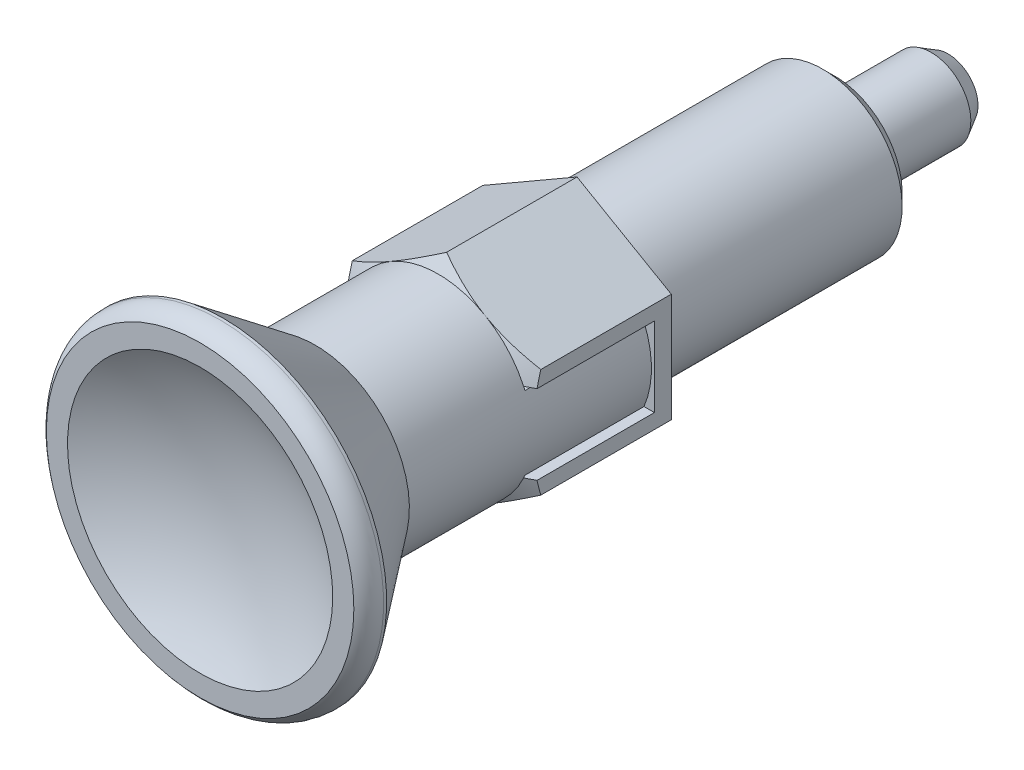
ISO-10303-21;
HEADER;
FILE_DESCRIPTION(('STEP AP214'),'2;1');
FILE_NAME('part.step','',(''),(''),'','','');
FILE_SCHEMA(('AUTOMOTIVE_DESIGN { 1 0 10303 214 1 1 1 1 }'));
ENDSEC;
DATA;
#1=APPLICATION_CONTEXT('core data for automotive mechanical design processes');
#2=APPLICATION_PROTOCOL_DEFINITION('international standard','automotive_design',2000,#1);
#3=PRODUCT_CONTEXT('',#1,'mechanical');
#4=PRODUCT('Part','Part','',(#3));
#5=PRODUCT_RELATED_PRODUCT_CATEGORY('part','',(#4));
#6=PRODUCT_DEFINITION_FORMATION('','',#4);
#7=PRODUCT_DEFINITION_CONTEXT('part definition',#1,'design');
#8=PRODUCT_DEFINITION('design','',#6,#7);
#9=PRODUCT_DEFINITION_SHAPE('','',#8);
#10=(LENGTH_UNIT() NAMED_UNIT(*) SI_UNIT(.MILLI.,.METRE.));
#11=(NAMED_UNIT(*) PLANE_ANGLE_UNIT() SI_UNIT($,.RADIAN.));
#12=(NAMED_UNIT(*) SI_UNIT($,.STERADIAN.) SOLID_ANGLE_UNIT());
#13=UNCERTAINTY_MEASURE_WITH_UNIT(LENGTH_MEASURE(1.E-05),#10,'distance_accuracy_value','');
#14=(GEOMETRIC_REPRESENTATION_CONTEXT(3) GLOBAL_UNCERTAINTY_ASSIGNED_CONTEXT((#13)) GLOBAL_UNIT_ASSIGNED_CONTEXT((#10,
#11,#12)) REPRESENTATION_CONTEXT('',''));
#15=CARTESIAN_POINT('',(0.,0.,0.));
#16=DIRECTION('',(0.,0.,1.));
#17=DIRECTION('',(1.,0.,0.));
#18=AXIS2_PLACEMENT_3D('',#15,#16,#17);
#19=CARTESIAN_POINT('',(0.,0.,-26.));
#20=DIRECTION('',(0.,0.,1.));
#21=DIRECTION('',(0.,-1.,0.));
#22=AXIS2_PLACEMENT_3D('',#19,#20,#21);
#23=CYLINDRICAL_SURFACE('',#22,8.);
#24=CARTESIAN_POINT('',(0.,0.,0.));
#25=DIRECTION('',(0.,0.,1.));
#26=DIRECTION('',(0.,-1.,0.));
#27=AXIS2_PLACEMENT_3D('',#24,#25,#26);
#28=CIRCLE('',#27,8.);
#29=CARTESIAN_POINT('',(0.,-8.,0.));
#30=VERTEX_POINT('',#29);
#31=EDGE_CURVE('E539',#30,#30,#28,.T.);
#32=ORIENTED_EDGE('',*,*,#31,.F.);
#33=EDGE_LOOP('',(#32));
#34=FACE_BOUND('',#33,.T.);
#35=CARTESIAN_POINT('',(0.,0.,-24.773));
#36=DIRECTION('',(0.,0.,1.));
#37=DIRECTION('',(0.,-1.,0.));
#38=AXIS2_PLACEMENT_3D('',#35,#36,#37);
#39=CIRCLE('',#38,8.);
#40=CARTESIAN_POINT('',(0.,-8.,-24.773));
#41=VERTEX_POINT('',#40);
#42=EDGE_CURVE('E577',#41,#41,#39,.T.);
#43=ORIENTED_EDGE('',*,*,#42,.T.);
#44=EDGE_LOOP('',(#43));
#45=FACE_BOUND('',#44,.T.);
#46=ADVANCED_FACE('F14',(#34,#45),#23,.T.);
#47=CARTESIAN_POINT('',(8.61684396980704,-4.,1.7));
#48=DIRECTION('',(0.,-1.,0.));
#49=DIRECTION('',(1.,0.,0.));
#50=AXIS2_PLACEMENT_3D('',#47,#48,#49);
#51=PLANE('',#50);
#52=DIRECTION('',(1.,0.,0.));
#53=VECTOR('',#52,1.);
#54=CARTESIAN_POINT('',(0.,-4.,1.7));
#55=LINE('',#54,#53);
#56=CARTESIAN_POINT('',(5.5,-4.,1.7));
#57=VERTEX_POINT('',#56);
#58=CARTESIAN_POINT('',(9.5,-4.,1.7));
#59=VERTEX_POINT('',#58);
#60=EDGE_CURVE('E134',#57,#59,#55,.T.);
#61=ORIENTED_EDGE('',*,*,#60,.F.);
#62=DIRECTION('',(0.,0.,1.));
#63=VECTOR('',#62,1.);
#64=CARTESIAN_POINT('',(5.5,-4.,14.));
#65=LINE('',#64,#63);
#66=CARTESIAN_POINT('',(5.5,-4.,14.));
#67=VERTEX_POINT('',#66);
#68=EDGE_CURVE('E308',#67,#57,#65,.F.);
#69=ORIENTED_EDGE('',*,*,#68,.F.);
#70=DIRECTION('',(1.,0.,0.));
#71=VECTOR('',#70,1.);
#72=CARTESIAN_POINT('',(11.5,-4.,14.));
#73=LINE('',#72,#71);
#74=CARTESIAN_POINT('',(8.61684396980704,-4.,14.));
#75=VERTEX_POINT('',#74);
#76=EDGE_CURVE('E309',#75,#67,#73,.F.);
#77=ORIENTED_EDGE('',*,*,#76,.F.);
#78=CARTESIAN_POINT('',(9.5,-4.,13.5336372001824));
#79=CARTESIAN_POINT('',(9.35306307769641,-4.,13.6118486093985));
#80=CARTESIAN_POINT('',(9.20599828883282,-4.,13.689817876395));
#81=CARTESIAN_POINT('',(8.91161294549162,-4.,13.8452721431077));
#82=CARTESIAN_POINT('',(8.76429239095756,-4.,13.9227571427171));
#83=CARTESIAN_POINT('',(8.61684396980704,-4.,14.));
#84=B_SPLINE_CURVE_WITH_KNOTS('',3,(#78,#79,#80,#81,#82,#83),.UNSPECIFIED.,.F.,.F.,(4,2,4),(0.,
0.499364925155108,0.998729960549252),.UNSPECIFIED.);
#85=CARTESIAN_POINT('',(9.5,-4.,13.5336372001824));
#86=VERTEX_POINT('',#85);
#87=EDGE_CURVE('E127',#86,#75,#84,.T.);
#88=ORIENTED_EDGE('',*,*,#87,.F.);
#89=DIRECTION('',(0.,0.,1.));
#90=VECTOR('',#89,1.);
#91=CARTESIAN_POINT('',(9.5,-4.,0.));
#92=LINE('',#91,#90);
#93=EDGE_CURVE('E538',#59,#86,#92,.T.);
#94=ORIENTED_EDGE('',*,*,#93,.F.);
#95=EDGE_LOOP('',(#61,#69,#77,#88,#94));
#96=FACE_BOUND('',#95,.T.);
#97=ADVANCED_FACE('F948',(#96),#51,.F.);
#98=CARTESIAN_POINT('',(0.,0.,1.7));
#99=DIRECTION('',(0.,0.,1.));
#100=DIRECTION('',(0.,-1.,0.));
#101=AXIS2_PLACEMENT_3D('',#98,#99,#100);
#102=PLANE('',#101);
#103=ORIENTED_EDGE('',*,*,#60,.T.);
#104=DIRECTION('',(0.,1.,0.));
#105=VECTOR('',#104,1.);
#106=CARTESIAN_POINT('',(9.5,-5.48482755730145,1.7));
#107=LINE('',#106,#105);
#108=CARTESIAN_POINT('',(9.5,4.,1.7));
#109=VERTEX_POINT('',#108);
#110=EDGE_CURVE('E552',#109,#59,#107,.F.);
#111=ORIENTED_EDGE('',*,*,#110,.F.);
#112=DIRECTION('',(-1.,0.,0.));
#113=VECTOR('',#112,1.);
#114=CARTESIAN_POINT('',(17.,4.,1.7));
#115=LINE('',#114,#113);
#116=CARTESIAN_POINT('',(5.5,4.,1.7));
#117=VERTEX_POINT('',#116);
#118=EDGE_CURVE('E559',#109,#117,#115,.T.);
#119=ORIENTED_EDGE('',*,*,#118,.T.);
#120=DIRECTION('',(0.,1.,0.));
#121=VECTOR('',#120,1.);
#122=CARTESIAN_POINT('',(5.5,0.,1.7));
#123=LINE('',#122,#121);
#124=EDGE_CURVE('E558',#57,#117,#123,.T.);
#125=ORIENTED_EDGE('',*,*,#124,.F.);
#126=EDGE_LOOP('',(#103,#111,#119,#125));
#127=FACE_BOUND('',#126,.T.);
#128=ADVANCED_FACE('F958',(#127),#102,.T.);
#129=CARTESIAN_POINT('',(17.,4.,1.7));
#130=DIRECTION('',(0.,1.,0.));
#131=DIRECTION('',(-1.,0.,0.));
#132=AXIS2_PLACEMENT_3D('',#129,#130,#131);
#133=PLANE('',#132);
#134=CARTESIAN_POINT('',(8.61684396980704,4.,14.));
#135=CARTESIAN_POINT('',(8.76429239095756,4.,13.9227571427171));
#136=CARTESIAN_POINT('',(8.91161294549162,4.,13.8452721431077));
#137=CARTESIAN_POINT('',(9.20599828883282,4.,13.689817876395));
#138=CARTESIAN_POINT('',(9.35306307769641,4.,13.6118486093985));
#139=CARTESIAN_POINT('',(9.5,4.,13.5336372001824));
#140=B_SPLINE_CURVE_WITH_KNOTS('',3,(#134,#135,#136,#137,#138,#139),.UNSPECIFIED.,.F.,.F.,(4,2,
4),(0.,0.499365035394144,0.998729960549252),.UNSPECIFIED.);
#141=CARTESIAN_POINT('',(8.61684396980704,4.,14.));
#142=VERTEX_POINT('',#141);
#143=CARTESIAN_POINT('',(9.5,4.,13.5336372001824));
#144=VERTEX_POINT('',#143);
#145=EDGE_CURVE('E561',#142,#144,#140,.T.);
#146=ORIENTED_EDGE('',*,*,#145,.F.);
#147=DIRECTION('',(1.,0.,0.));
#148=VECTOR('',#147,1.);
#149=CARTESIAN_POINT('',(11.5,4.,14.));
#150=LINE('',#149,#148);
#151=CARTESIAN_POINT('',(5.5,4.,14.));
#152=VERTEX_POINT('',#151);
#153=EDGE_CURVE('E288',#152,#142,#150,.T.);
#154=ORIENTED_EDGE('',*,*,#153,.F.);
#155=DIRECTION('',(0.,0.,1.));
#156=VECTOR('',#155,1.);
#157=CARTESIAN_POINT('',(5.5,4.,14.));
#158=LINE('',#157,#156);
#159=EDGE_CURVE('E556',#117,#152,#158,.T.);
#160=ORIENTED_EDGE('',*,*,#159,.F.);
#161=ORIENTED_EDGE('',*,*,#118,.F.);
#162=DIRECTION('',(0.,0.,1.));
#163=VECTOR('',#162,1.);
#164=CARTESIAN_POINT('',(9.5,4.,0.));
#165=LINE('',#164,#163);
#166=EDGE_CURVE('E553',#144,#109,#165,.F.);
#167=ORIENTED_EDGE('',*,*,#166,.F.);
#168=EDGE_LOOP('',(#146,#154,#160,#161,#167));
#169=FACE_BOUND('',#168,.T.);
#170=ADVANCED_FACE('F527',(#169),#133,.F.);
#171=CARTESIAN_POINT('',(9.5,-5.48482755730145,0.));
#172=DIRECTION('',(1.,0.,0.));
#173=DIRECTION('',(0.,1.,0.));
#174=AXIS2_PLACEMENT_3D('',#171,#172,#173);
#175=PLANE('',#174);
#176=ORIENTED_EDGE('',*,*,#93,.T.);
#177=CARTESIAN_POINT('',(9.5,-4.,13.5336372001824));
#178=CARTESIAN_POINT('',(9.5,-4.12471293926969,13.5056957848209));
#179=CARTESIAN_POINT('',(9.5,-4.24918721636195,13.4766981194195));
#180=CARTESIAN_POINT('',(9.5,-4.4976263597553,13.4167165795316));
#181=CARTESIAN_POINT('',(9.5,-4.62159133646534,13.3857331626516));
#182=CARTESIAN_POINT('',(9.5,-4.86903446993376,13.3218941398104));
#183=CARTESIAN_POINT('',(9.5,-4.99251263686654,13.2890385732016));
#184=CARTESIAN_POINT('',(9.5,-5.2390161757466,13.221561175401));
#185=CARTESIAN_POINT('',(9.5,-5.36204143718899,13.1869389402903));
#186=CARTESIAN_POINT('',(9.5,-5.48482759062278,13.1514942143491));
#187=B_SPLINE_CURVE_WITH_KNOTS('',3,(#177,#178,#179,#180,#181,#182,#183,#184,#185,#186),
.UNSPECIFIED.,.F.,.F.,(4,2,2,2,4),(0.,0.383406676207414,0.766725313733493,1.15003589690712,
1.53343451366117),.UNSPECIFIED.);
#188=CARTESIAN_POINT('',(9.5,-5.48482757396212,13.1514942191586));
#189=VERTEX_POINT('',#188);
#190=EDGE_CURVE('E532',#86,#189,#187,.T.);
#191=ORIENTED_EDGE('',*,*,#190,.T.);
#192=DIRECTION('',(0.,0.,1.));
#193=VECTOR('',#192,1.);
#194=CARTESIAN_POINT('',(9.5,-5.48482755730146,0.));
#195=LINE('',#194,#193);
#196=CARTESIAN_POINT('',(9.5,-5.48482755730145,0.));
#197=VERTEX_POINT('',#196);
#198=EDGE_CURVE('E312',#197,#189,#195,.T.);
#199=ORIENTED_EDGE('',*,*,#198,.F.);
#200=DIRECTION('',(0.,1.,0.));
#201=VECTOR('',#200,1.);
#202=CARTESIAN_POINT('',(9.5,0.,0.));
#203=LINE('',#202,#201);
#204=CARTESIAN_POINT('',(9.5,5.48482755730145,0.));
#205=VERTEX_POINT('',#204);
#206=EDGE_CURVE('E537',#205,#197,#203,.F.);
#207=ORIENTED_EDGE('',*,*,#206,.F.);
#208=DIRECTION('',(0.,0.,1.));
#209=VECTOR('',#208,1.);
#210=CARTESIAN_POINT('',(9.5,5.48482755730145,0.));
#211=LINE('',#210,#209);
#212=CARTESIAN_POINT('',(9.5,5.48482755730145,13.1514942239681));
#213=VERTEX_POINT('',#212);
#214=EDGE_CURVE('E285',#213,#205,#211,.F.);
#215=ORIENTED_EDGE('',*,*,#214,.F.);
#216=CARTESIAN_POINT('',(9.5,5.48482755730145,13.1514942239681));
#217=CARTESIAN_POINT('',(9.5,5.36204140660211,13.1869389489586));
#218=CARTESIAN_POINT('',(9.5,5.23901614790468,13.2215611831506));
#219=CARTESIAN_POINT('',(9.5,4.99251261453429,13.2890385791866));
#220=CARTESIAN_POINT('',(9.5,4.8690344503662,13.3218941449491));
#221=CARTESIAN_POINT('',(9.5,4.62159132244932,13.3857331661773));
#222=CARTESIAN_POINT('',(9.5,4.49762634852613,13.4167165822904));
#223=CARTESIAN_POINT('',(9.5,4.2491872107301,13.4766981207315));
#224=CARTESIAN_POINT('',(9.5,4.12471293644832,13.505695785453));
#225=CARTESIAN_POINT('',(9.5,4.,13.5336372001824));
#226=B_SPLINE_CURVE_WITH_KNOTS('',3,(#216,#217,#218,#219,#220,#221,#222,#223,#224,#225),
.UNSPECIFIED.,.F.,.F.,(4,2,2,2,4),(0.,0.383398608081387,0.766709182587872,1.15002781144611,
1.53343447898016),.UNSPECIFIED.);
#227=EDGE_CURVE('E427',#213,#144,#226,.T.);
#228=ORIENTED_EDGE('',*,*,#227,.T.);
#229=ORIENTED_EDGE('',*,*,#166,.T.);
#230=ORIENTED_EDGE('',*,*,#110,.T.);
#231=EDGE_LOOP('',(#176,#191,#199,#207,#215,#228,#229,#230));
#232=FACE_BOUND('',#231,.T.);
#233=ADVANCED_FACE('F522',(#232),#175,.T.);
#234=CARTESIAN_POINT('',(8.,0.,0.));
#235=DIRECTION('',(0.,0.,-1.));
#236=DIRECTION('',(0.,1.,0.));
#237=AXIS2_PLACEMENT_3D('',#234,#235,#236);
#238=PLANE('',#237);
#239=ORIENTED_EDGE('',*,*,#31,.T.);
#240=EDGE_LOOP('',(#239));
#241=FACE_BOUND('',#240,.T.);
#242=DIRECTION('',(0.,-1.,0.));
#243=VECTOR('',#242,1.);
#244=CARTESIAN_POINT('',(-9.5,5.48482755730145,0.));
#245=LINE('',#244,#243);
#246=CARTESIAN_POINT('',(-9.5,5.48482755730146,0.));
#247=VERTEX_POINT('',#246);
#248=CARTESIAN_POINT('',(-9.5,-5.48482755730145,0.));
#249=VERTEX_POINT('',#248);
#250=EDGE_CURVE('E505',#247,#249,#245,.T.);
#251=ORIENTED_EDGE('',*,*,#250,.F.);
#252=DIRECTION('',(-0.866025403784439,-0.5,0.));
#253=VECTOR('',#252,1.);
#254=CARTESIAN_POINT('',(0.,10.9696551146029,0.));
#255=LINE('',#254,#253);
#256=CARTESIAN_POINT('',(0.,10.9696551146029,0.));
#257=VERTEX_POINT('',#256);
#258=EDGE_CURVE('E275',#257,#247,#255,.T.);
#259=ORIENTED_EDGE('',*,*,#258,.F.);
#260=DIRECTION('',(-0.866025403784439,0.5,0.));
#261=VECTOR('',#260,1.);
#262=CARTESIAN_POINT('',(9.5,5.48482755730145,0.));
#263=LINE('',#262,#261);
#264=EDGE_CURVE('E279',#205,#257,#263,.T.);
#265=ORIENTED_EDGE('',*,*,#264,.F.);
#266=ORIENTED_EDGE('',*,*,#206,.T.);
#267=DIRECTION('',(0.866025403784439,0.5,0.));
#268=VECTOR('',#267,1.);
#269=CARTESIAN_POINT('',(0.,-10.9696551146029,0.));
#270=LINE('',#269,#268);
#271=CARTESIAN_POINT('',(0.,-10.9696551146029,0.));
#272=VERTEX_POINT('',#271);
#273=EDGE_CURVE('E315',#272,#197,#270,.T.);
#274=ORIENTED_EDGE('',*,*,#273,.F.);
#275=DIRECTION('',(0.866025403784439,-0.5,0.));
#276=VECTOR('',#275,1.);
#277=CARTESIAN_POINT('',(-9.5,-5.48482755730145,0.));
#278=LINE('',#277,#276);
#279=EDGE_CURVE('E319',#249,#272,#278,.T.);
#280=ORIENTED_EDGE('',*,*,#279,.F.);
#281=EDGE_LOOP('',(#251,#259,#265,#266,#274,#280));
#282=FACE_BOUND('',#281,.T.);
#283=ADVANCED_FACE('F517',(#241,#282),#238,.T.);
#284=CARTESIAN_POINT('',(-9.5,5.48482755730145,0.));
#285=DIRECTION('',(-1.,0.,0.));
#286=DIRECTION('',(0.,-1.,0.));
#287=AXIS2_PLACEMENT_3D('',#284,#285,#286);
#288=PLANE('',#287);
#289=DIRECTION('',(0.,0.,1.));
#290=VECTOR('',#289,1.);
#291=CARTESIAN_POINT('',(-9.5,-5.48482755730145,0.));
#292=LINE('',#291,#290);
#293=CARTESIAN_POINT('',(-9.5,-5.48482755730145,13.1514942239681));
#294=VERTEX_POINT('',#293);
#295=EDGE_CURVE('E325',#294,#249,#292,.F.);
#296=ORIENTED_EDGE('',*,*,#295,.F.);
#297=CARTESIAN_POINT('',(-9.5,-5.48482755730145,13.1514942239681));
#298=CARTESIAN_POINT('',(-9.5,-5.36204140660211,13.1869389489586));
#299=CARTESIAN_POINT('',(-9.5,-5.23901614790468,13.2215611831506));
#300=CARTESIAN_POINT('',(-9.5,-4.99251261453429,13.2890385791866));
#301=CARTESIAN_POINT('',(-9.5,-4.8690344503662,13.3218941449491));
#302=CARTESIAN_POINT('',(-9.5,-4.62159132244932,13.3857331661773));
#303=CARTESIAN_POINT('',(-9.5,-4.49762634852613,13.4167165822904));
#304=CARTESIAN_POINT('',(-9.5,-4.2491872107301,13.4766981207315));
#305=CARTESIAN_POINT('',(-9.5,-4.12471293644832,13.505695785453));
#306=CARTESIAN_POINT('',(-9.5,-4.,13.5336372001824));
#307=B_SPLINE_CURVE_WITH_KNOTS('',3,(#297,#298,#299,#300,#301,#302,#303,#304,#305,#306),
.UNSPECIFIED.,.F.,.F.,(4,2,2,2,4),(0.,0.383398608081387,0.766709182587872,1.15002781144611,
1.53343447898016),.UNSPECIFIED.);
#308=CARTESIAN_POINT('',(-9.5,-4.,13.5336372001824));
#309=VERTEX_POINT('',#308);
#310=EDGE_CURVE('E497',#294,#309,#307,.T.);
#311=ORIENTED_EDGE('',*,*,#310,.T.);
#312=DIRECTION('',(0.,0.,1.));
#313=VECTOR('',#312,1.);
#314=CARTESIAN_POINT('',(-9.5,-4.,1.7));
#315=LINE('',#314,#313);
#316=CARTESIAN_POINT('',(-9.5,-4.,1.7));
#317=VERTEX_POINT('',#316);
#318=EDGE_CURVE('E633',#309,#317,#315,.F.);
#319=ORIENTED_EDGE('',*,*,#318,.T.);
#320=DIRECTION('',(0.,-1.,0.));
#321=VECTOR('',#320,1.);
#322=CARTESIAN_POINT('',(-9.5,0.,1.7));
#323=LINE('',#322,#321);
#324=CARTESIAN_POINT('',(-9.5,4.,1.7));
#325=VERTEX_POINT('',#324);
#326=EDGE_CURVE('E570',#325,#317,#323,.T.);
#327=ORIENTED_EDGE('',*,*,#326,.F.);
#328=DIRECTION('',(0.,0.,1.));
#329=VECTOR('',#328,1.);
#330=CARTESIAN_POINT('',(-9.5,4.,1.7));
#331=LINE('',#330,#329);
#332=CARTESIAN_POINT('',(-9.5,4.,13.5336372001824));
#333=VERTEX_POINT('',#332);
#334=EDGE_CURVE('E612',#325,#333,#331,.T.);
#335=ORIENTED_EDGE('',*,*,#334,.T.);
#336=CARTESIAN_POINT('',(-9.5,4.,13.5336372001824));
#337=CARTESIAN_POINT('',(-9.5,4.12471293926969,13.5056957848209));
#338=CARTESIAN_POINT('',(-9.5,4.24918721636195,13.4766981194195));
#339=CARTESIAN_POINT('',(-9.5,4.4976263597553,13.4167165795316));
#340=CARTESIAN_POINT('',(-9.5,4.62159133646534,13.3857331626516));
#341=CARTESIAN_POINT('',(-9.5,4.86903446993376,13.3218941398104));
#342=CARTESIAN_POINT('',(-9.5,4.99251263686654,13.2890385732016));
#343=CARTESIAN_POINT('',(-9.5,5.2390161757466,13.221561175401));
#344=CARTESIAN_POINT('',(-9.5,5.36204143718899,13.1869389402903));
#345=CARTESIAN_POINT('',(-9.5,5.48482759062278,13.1514942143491));
#346=B_SPLINE_CURVE_WITH_KNOTS('',3,(#336,#337,#338,#339,#340,#341,#342,#343,#344,#345),
.UNSPECIFIED.,.F.,.F.,(4,2,2,2,4),(0.,0.383406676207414,0.766725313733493,1.15003589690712,
1.53343451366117),.UNSPECIFIED.);
#347=CARTESIAN_POINT('',(-9.5,5.48482757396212,13.1514942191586));
#348=VERTEX_POINT('',#347);
#349=EDGE_CURVE('E506',#333,#348,#346,.T.);
#350=ORIENTED_EDGE('',*,*,#349,.T.);
#351=DIRECTION('',(0.,0.,1.));
#352=VECTOR('',#351,1.);
#353=CARTESIAN_POINT('',(-9.5,5.48482755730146,0.));
#354=LINE('',#353,#352);
#355=EDGE_CURVE('E272',#247,#348,#354,.T.);
#356=ORIENTED_EDGE('',*,*,#355,.F.);
#357=ORIENTED_EDGE('',*,*,#250,.T.);
#358=EDGE_LOOP('',(#296,#311,#319,#327,#335,#350,#356,#357));
#359=FACE_BOUND('',#358,.T.);
#360=ADVANCED_FACE('F512',(#359),#288,.T.);
#361=CARTESIAN_POINT('',(-17.,-4.,1.7));
#362=DIRECTION('',(0.,-1.,0.));
#363=DIRECTION('',(1.,0.,0.));
#364=AXIS2_PLACEMENT_3D('',#361,#362,#363);
#365=PLANE('',#364);
#366=CARTESIAN_POINT('',(-8.61684396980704,-4.,14.));
#367=CARTESIAN_POINT('',(-8.76429239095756,-4.,13.9227571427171));
#368=CARTESIAN_POINT('',(-8.91161294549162,-4.,13.8452721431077));
#369=CARTESIAN_POINT('',(-9.20599828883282,-4.,13.689817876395));
#370=CARTESIAN_POINT('',(-9.35306307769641,-4.,13.6118486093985));
#371=CARTESIAN_POINT('',(-9.5,-4.,13.5336372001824));
#372=B_SPLINE_CURVE_WITH_KNOTS('',3,(#366,#367,#368,#369,#370,#371),.UNSPECIFIED.,.F.,.F.,(4,2,
4),(0.,0.499365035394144,0.998729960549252),.UNSPECIFIED.);
#373=CARTESIAN_POINT('',(-8.61684396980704,-4.,14.));
#374=VERTEX_POINT('',#373);
#375=EDGE_CURVE('E489',#374,#309,#372,.T.);
#376=ORIENTED_EDGE('',*,*,#375,.F.);
#377=DIRECTION('',(1.,0.,0.));
#378=VECTOR('',#377,1.);
#379=CARTESIAN_POINT('',(-11.5,-4.,14.));
#380=LINE('',#379,#378);
#381=CARTESIAN_POINT('',(-5.5,-4.,14.));
#382=VERTEX_POINT('',#381);
#383=EDGE_CURVE('E328',#374,#382,#380,.T.);
#384=ORIENTED_EDGE('',*,*,#383,.T.);
#385=DIRECTION('',(0.,0.,1.));
#386=VECTOR('',#385,1.);
#387=CARTESIAN_POINT('',(-5.5,-4.,14.));
#388=LINE('',#387,#386);
#389=CARTESIAN_POINT('',(-5.5,-4.,1.7));
#390=VERTEX_POINT('',#389);
#391=EDGE_CURVE('E266',#382,#390,#388,.F.);
#392=ORIENTED_EDGE('',*,*,#391,.T.);
#393=DIRECTION('',(1.,0.,0.));
#394=VECTOR('',#393,1.);
#395=CARTESIAN_POINT('',(0.,-4.,1.7));
#396=LINE('',#395,#394);
#397=EDGE_CURVE('E574',#317,#390,#396,.T.);
#398=ORIENTED_EDGE('',*,*,#397,.F.);
#399=ORIENTED_EDGE('',*,*,#318,.F.);
#400=EDGE_LOOP('',(#376,#384,#392,#398,#399));
#401=FACE_BOUND('',#400,.T.);
#402=ADVANCED_FACE('F516',(#401),#365,.F.);
#403=CARTESIAN_POINT('',(0.,0.,1.7));
#404=DIRECTION('',(0.,0.,1.));
#405=DIRECTION('',(0.,-1.,0.));
#406=AXIS2_PLACEMENT_3D('',#403,#404,#405);
#407=PLANE('',#406);
#408=DIRECTION('',(-1.,0.,0.));
#409=VECTOR('',#408,1.);
#410=CARTESIAN_POINT('',(-8.61684396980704,4.,1.7));
#411=LINE('',#410,#409);
#412=CARTESIAN_POINT('',(-5.5,4.,1.7));
#413=VERTEX_POINT('',#412);
#414=EDGE_CURVE('E617',#413,#325,#411,.T.);
#415=ORIENTED_EDGE('',*,*,#414,.T.);
#416=ORIENTED_EDGE('',*,*,#326,.T.);
#417=ORIENTED_EDGE('',*,*,#397,.T.);
#418=DIRECTION('',(0.,1.,0.));
#419=VECTOR('',#418,1.);
#420=CARTESIAN_POINT('',(-5.5,0.,1.7));
#421=LINE('',#420,#419);
#422=EDGE_CURVE('E629',#390,#413,#421,.T.);
#423=ORIENTED_EDGE('',*,*,#422,.T.);
#424=EDGE_LOOP('',(#415,#416,#417,#423));
#425=FACE_BOUND('',#424,.T.);
#426=ADVANCED_FACE('F661',(#425),#407,.T.);
#427=CARTESIAN_POINT('',(-8.61684396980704,4.,1.7));
#428=DIRECTION('',(0.,1.,0.));
#429=DIRECTION('',(-1.,0.,0.));
#430=AXIS2_PLACEMENT_3D('',#427,#428,#429);
#431=PLANE('',#430);
#432=ORIENTED_EDGE('',*,*,#414,.F.);
#433=DIRECTION('',(0.,0.,1.));
#434=VECTOR('',#433,1.);
#435=CARTESIAN_POINT('',(-5.5,4.,14.));
#436=LINE('',#435,#434);
#437=CARTESIAN_POINT('',(-5.5,4.,14.));
#438=VERTEX_POINT('',#437);
#439=EDGE_CURVE('E271',#413,#438,#436,.T.);
#440=ORIENTED_EDGE('',*,*,#439,.T.);
#441=DIRECTION('',(1.,0.,0.));
#442=VECTOR('',#441,1.);
#443=CARTESIAN_POINT('',(-11.5,4.,14.));
#444=LINE('',#443,#442);
#445=CARTESIAN_POINT('',(-8.61684396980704,4.,14.));
#446=VERTEX_POINT('',#445);
#447=EDGE_CURVE('E263',#438,#446,#444,.F.);
#448=ORIENTED_EDGE('',*,*,#447,.T.);
#449=CARTESIAN_POINT('',(-9.5,4.,13.5336372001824));
#450=CARTESIAN_POINT('',(-9.35306307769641,4.,13.6118486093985));
#451=CARTESIAN_POINT('',(-9.20599828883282,4.,13.689817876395));
#452=CARTESIAN_POINT('',(-8.91161294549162,4.,13.8452721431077));
#453=CARTESIAN_POINT('',(-8.76429239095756,4.,13.9227571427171));
#454=CARTESIAN_POINT('',(-8.61684396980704,4.,14.));
#455=B_SPLINE_CURVE_WITH_KNOTS('',3,(#449,#450,#451,#452,#453,#454),.UNSPECIFIED.,.F.,.F.,(4,2,
4),(0.,0.499364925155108,0.998729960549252),.UNSPECIFIED.);
#456=EDGE_CURVE('E573',#333,#446,#455,.T.);
#457=ORIENTED_EDGE('',*,*,#456,.F.);
#458=ORIENTED_EDGE('',*,*,#334,.F.);
#459=EDGE_LOOP('',(#432,#440,#448,#457,#458));
#460=FACE_BOUND('',#459,.T.);
#461=ADVANCED_FACE('F345',(#460),#431,.F.);
#462=CARTESIAN_POINT('',(0.,0.,60.3));
#463=DIRECTION('',(-1.,0.,0.));
#464=DIRECTION('',(0.,1.,0.));
#465=AXIS2_PLACEMENT_3D('',#462,#463,#464);
#466=SPHERICAL_SURFACE('',#465,26.);
#467=CARTESIAN_POINT('',(0.,13.36824595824,38.));
#468=CARTESIAN_POINT('',(-0.375585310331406,13.3682486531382,38.));
#469=CARTESIAN_POINT('',(-0.751126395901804,13.3524111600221,38.));
#470=CARTESIAN_POINT('',(-1.49966463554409,13.2891717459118,38.));
#471=CARTESIAN_POINT('',(-1.87266109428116,13.2417615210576,38.));
#472=CARTESIAN_POINT('',(-2.61372997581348,13.1156339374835,38.));
#473=CARTESIAN_POINT('',(-2.98179666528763,13.0368829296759,38.));
#474=CARTESIAN_POINT('',(-3.70998226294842,12.848636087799,38.));
#475=CARTESIAN_POINT('',(-4.07010119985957,12.7391403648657,38.));
#476=CARTESIAN_POINT('',(-4.7796552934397,12.490243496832,38.));
#477=CARTESIAN_POINT('',(-5.12909553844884,12.3508568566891,38.));
#478=CARTESIAN_POINT('',(-5.81499557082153,12.0431356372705,38.));
#479=CARTESIAN_POINT('',(-6.15145515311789,11.8748006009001,38.));
#480=CARTESIAN_POINT('',(-6.80891126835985,11.5104276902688,38.));
#481=CARTESIAN_POINT('',(-7.12991172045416,11.314396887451,38.));
#482=CARTESIAN_POINT('',(-7.75425858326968,10.8959942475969,38.));
#483=CARTESIAN_POINT('',(-8.05760506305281,10.6736225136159,38.));
#484=CARTESIAN_POINT('',(-8.64452045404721,10.2040929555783,38.));
#485=CARTESIAN_POINT('',(-8.9280872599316,9.95693249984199,38.));
#486=CARTESIAN_POINT('',(-9.47339223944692,9.43960204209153,38.));
#487=CARTESIAN_POINT('',(-9.73513039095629,9.16943201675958,38.));
#488=CARTESIAN_POINT('',(-10.2349267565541,8.607992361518,38.));
#489=CARTESIAN_POINT('',(-10.472984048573,8.31672191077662,38.));
#490=CARTESIAN_POINT('',(-10.9237145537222,7.71516160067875,38.));
#491=CARTESIAN_POINT('',(-11.1363877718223,7.40487174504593,38.));
#492=CARTESIAN_POINT('',(-11.5348344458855,6.76748455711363,38.));
#493=CARTESIAN_POINT('',(-11.7206084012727,6.44038753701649,38.));
#494=CARTESIAN_POINT('',(-12.0639405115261,5.77170618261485,38.));
#495=CARTESIAN_POINT('',(-12.2214986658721,5.4301218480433,38.));
#496=CARTESIAN_POINT('',(-12.507278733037,4.73489504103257,38.));
#497=CARTESIAN_POINT('',(-12.6355007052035,4.38125259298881,38.));
#498=CARTESIAN_POINT('',(-12.8616972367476,3.66442308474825,38.));
#499=CARTESIAN_POINT('',(-12.95967179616,3.30123602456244,38.));
#500=CARTESIAN_POINT('',(-13.1246771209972,2.56789862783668,38.));
#501=CARTESIAN_POINT('',(-13.1917078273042,2.19774827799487,38.));
#502=CARTESIAN_POINT('',(-13.2943486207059,1.45311652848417,38.));
#503=CARTESIAN_POINT('',(-13.3299587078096,1.07863512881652,38.));
#504=CARTESIAN_POINT('',(-13.3695050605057,0.328004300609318,38.));
#505=CARTESIAN_POINT('',(-13.373441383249,-0.0481451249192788,38.));
#506=CARTESIAN_POINT('',(-13.3496123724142,-0.799438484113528,38.));
#507=CARTESIAN_POINT('',(-13.3218470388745,-1.1745824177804,38.));
#508=CARTESIAN_POINT('',(-13.2348120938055,-1.92119788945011,38.));
#509=CARTESIAN_POINT('',(-13.1755424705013,-2.29266942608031,38.));
#510=CARTESIAN_POINT('',(-13.0259203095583,-3.02929902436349,38.));
#511=CARTESIAN_POINT('',(-12.9355677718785,-3.39445708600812,38.));
#512=CARTESIAN_POINT('',(-12.7244220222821,-4.11586406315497,38.));
#513=CARTESIAN_POINT('',(-12.6036287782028,-4.47211296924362,38.));
#514=CARTESIAN_POINT('',(-12.3324604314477,-5.17316851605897,38.));
#515=CARTESIAN_POINT('',(-12.1820853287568,-5.51797515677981,38.));
#516=CARTESIAN_POINT('',(-11.8528223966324,-6.19369469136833,38.));
#517=CARTESIAN_POINT('',(-11.673934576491,-6.52460758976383,38.));
#518=CARTESIAN_POINT('',(-11.2889179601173,-7.17018716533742,38.));
#519=CARTESIAN_POINT('',(-11.0827891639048,-7.48485384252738,38.));
#520=CARTESIAN_POINT('',(-10.6447561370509,-8.09570375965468,38.));
#521=CARTESIAN_POINT('',(-10.4128519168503,-8.39188700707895,38.));
#522=CARTESIAN_POINT('',(-9.92491667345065,-8.96366451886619,38.));
#523=CARTESIAN_POINT('',(-9.66888565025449,-9.23925878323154,38.));
#524=CARTESIAN_POINT('',(-9.13451699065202,-9.76789905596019,38.));
#525=CARTESIAN_POINT('',(-8.85617935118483,-10.0209450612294,38.));
#526=CARTESIAN_POINT('',(-8.27917630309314,-10.5026897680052,38.));
#527=CARTESIAN_POINT('',(-7.98051089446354,-10.7313884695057,38.));
#528=CARTESIAN_POINT('',(-7.36497559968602,-11.1628126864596,38.));
#529=CARTESIAN_POINT('',(-7.04810571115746,-11.3655381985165,38.));
#530=CARTESIAN_POINT('',(-6.39841424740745,-11.7435747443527,38.));
#531=CARTESIAN_POINT('',(-6.06559267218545,-11.9188857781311,38.));
#532=CARTESIAN_POINT('',(-5.38636401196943,-12.2408470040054,38.));
#533=CARTESIAN_POINT('',(-5.03995692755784,-12.3874971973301,38.));
#534=CARTESIAN_POINT('',(-4.33601998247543,-12.6510941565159,38.));
#535=CARTESIAN_POINT('',(-3.9784901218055,-12.7680409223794,38.));
#536=CARTESIAN_POINT('',(-3.25484946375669,-12.9713996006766,38.));
#537=CARTESIAN_POINT('',(-2.88873866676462,-13.057811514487,38.));
#538=CARTESIAN_POINT('',(-2.15053894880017,-13.1994861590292,38.));
#539=CARTESIAN_POINT('',(-1.77845002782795,-13.2547488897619,38.));
#540=CARTESIAN_POINT('',(-1.03093939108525,-13.3337322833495,38.));
#541=CARTESIAN_POINT('',(-0.655517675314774,-13.3574529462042,38.));
#542=CARTESIAN_POINT('',(0.0959895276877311,-13.3731835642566,38.));
#543=CARTESIAN_POINT('',(0.472075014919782,-13.3651935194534,38.));
#544=CARTESIAN_POINT('',(1.22223603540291,-13.3175595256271,38.));
#545=CARTESIAN_POINT('',(1.59631156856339,-13.277915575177,38.));
#546=CARTESIAN_POINT('',(2.33979321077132,-13.1672556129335,38.));
#547=CARTESIAN_POINT('',(2.70919931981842,-13.0962396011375,38.));
#548=CARTESIAN_POINT('',(3.44071587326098,-12.9233403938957,38.));
#549=CARTESIAN_POINT('',(3.80282631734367,-12.8214571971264,38.));
#550=CARTESIAN_POINT('',(4.51717713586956,-12.5875479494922,38.));
#551=CARTESIAN_POINT('',(4.8694175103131,-12.4555218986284,38.));
#552=CARTESIAN_POINT('',(5.5615239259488,-12.1622655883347,38.));
#553=CARTESIAN_POINT('',(5.90138996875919,-12.001035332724,38.));
#554=CARTESIAN_POINT('',(6.56633152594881,-11.650516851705,38.));
#555=CARTESIAN_POINT('',(6.89140704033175,-11.4612286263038,38.));
#556=CARTESIAN_POINT('',(7.52445640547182,-11.0559399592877,38.));
#557=CARTESIAN_POINT('',(7.83243025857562,-10.8399395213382,38.));
#558=CARTESIAN_POINT('',(8.42908684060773,-10.3827620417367,38.));
#559=CARTESIAN_POINT('',(8.71776956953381,-10.1415850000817,38.));
#560=CARTESIAN_POINT('',(9.27379165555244,-9.63576883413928,38.));
#561=CARTESIAN_POINT('',(9.54113100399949,-9.37112970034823,38.));
#562=CARTESIAN_POINT('',(10.0525655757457,-8.82027085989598,38.));
#563=CARTESIAN_POINT('',(10.296660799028,-8.534051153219,38.));
#564=CARTESIAN_POINT('',(10.7598718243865,-7.94206592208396,38.));
#565=CARTESIAN_POINT('',(10.9789876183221,-7.63630039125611,38.));
#566=CARTESIAN_POINT('',(11.3906819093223,-7.00739740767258,38.));
#567=CARTESIAN_POINT('',(11.5832604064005,-6.6842599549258,38.));
#568=CARTESIAN_POINT('',(11.9405107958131,-6.02291079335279,38.));
#569=CARTESIAN_POINT('',(12.1051827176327,-5.68469910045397,38.));
#570=CARTESIAN_POINT('',(12.405449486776,-4.99560562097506,38.));
#571=CARTESIAN_POINT('',(12.5410443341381,-4.64472383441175,38.));
#572=CARTESIAN_POINT('',(12.7821929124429,-3.93278485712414,38.));
#573=CARTESIAN_POINT('',(12.8877466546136,-3.57172767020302,38.));
#574=CARTESIAN_POINT('',(13.0680626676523,-2.84200466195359,38.));
#575=CARTESIAN_POINT('',(13.1428249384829,-2.47333884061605,38.));
#576=CARTESIAN_POINT('',(13.2610266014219,-1.7310188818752,38.));
#577=CARTESIAN_POINT('',(13.3044659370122,-1.35736473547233,38.));
#578=CARTESIAN_POINT('',(13.3597126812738,-0.607725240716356,38.));
#579=CARTESIAN_POINT('',(13.3715200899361,-0.231739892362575,38.));
#580=CARTESIAN_POINT('',(13.3634190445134,0.519888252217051,38.));
#581=CARTESIAN_POINT('',(13.3435106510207,0.895531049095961,38.));
#582=CARTESIAN_POINT('',(13.2721196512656,1.6438042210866,38.));
#583=CARTESIAN_POINT('',(13.2206370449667,2.01643459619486,38.));
#584=CARTESIAN_POINT('',(13.0864634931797,2.75603450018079,38.));
#585=CARTESIAN_POINT('',(13.0037724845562,3.12300401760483,38.));
#586=CARTESIAN_POINT('',(12.8077700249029,3.84867248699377,38.));
#587=CARTESIAN_POINT('',(12.6944585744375,4.20737143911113,38.));
#588=CARTESIAN_POINT('',(12.4380184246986,4.91395521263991,38.));
#589=CARTESIAN_POINT('',(12.2948891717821,5.26183983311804,38.));
#590=CARTESIAN_POINT('',(11.9798322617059,5.94431469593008,38.));
#591=CARTESIAN_POINT('',(11.8079045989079,6.27890493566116,38.));
#592=CARTESIAN_POINT('',(11.4364804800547,6.932399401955,38.));
#593=CARTESIAN_POINT('',(11.2369850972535,7.25130423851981,38.));
#594=CARTESIAN_POINT('',(10.8118388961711,7.87117441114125,38.));
#595=CARTESIAN_POINT('',(10.5861881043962,8.17213976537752,38.));
#596=CARTESIAN_POINT('',(10.1103604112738,8.7539607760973,38.));
#597=CARTESIAN_POINT('',(9.86018611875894,9.03481856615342,38.));
#598=CARTESIAN_POINT('',(9.33706848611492,9.57446448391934,38.));
#599=CARTESIAN_POINT('',(9.06412505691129,9.8332525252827,38.));
#600=CARTESIAN_POINT('',(8.49733759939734,10.3269813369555,38.));
#601=CARTESIAN_POINT('',(8.20348826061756,10.5619160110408,38.));
#602=CARTESIAN_POINT('',(7.59704532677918,11.0061886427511,38.));
#603=CARTESIAN_POINT('',(7.28445202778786,11.21552700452,38.));
#604=CARTESIAN_POINT('',(6.64258363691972,11.6072177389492,38.));
#605=CARTESIAN_POINT('',(6.3133005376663,11.7895569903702,38.));
#606=CARTESIAN_POINT('',(5.6405367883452,12.1258308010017,38.));
#607=CARTESIAN_POINT('',(5.29705608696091,12.2797652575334,38.));
#608=CARTESIAN_POINT('',(4.598711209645,12.5579840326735,38.));
#609=CARTESIAN_POINT('',(4.24385967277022,12.6823000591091,38.));
#610=CARTESIAN_POINT('',(3.52506734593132,12.9005804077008,38.));
#611=CARTESIAN_POINT('',(3.16112897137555,12.9945527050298,38.));
#612=CARTESIAN_POINT('',(2.33514245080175,13.1710678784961,38.));
#613=CARTESIAN_POINT('',(1.87121744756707,13.2449469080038,38.));
#614=CARTESIAN_POINT('',(0.938171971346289,13.3435342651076,38.));
#615=CARTESIAN_POINT('',(0.469051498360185,13.3682425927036,38.));
#616=CARTESIAN_POINT('',(0.,13.36824595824,38.));
#617=B_SPLINE_CURVE_WITH_KNOTS('',3,(#467,#468,#469,#470,#471,#472,#473,#474,#475,#476,#477,
#478,#479,#480,#481,#482,#483,#484,#485,#486,#487,#488,#489,#490,#491,#492,#493,#494,#495,#496,
#497,#498,#499,#500,#501,#502,#503,#504,#505,#506,#507,#508,#509,#510,#511,#512,#513,#514,#515,
#516,#517,#518,#519,#520,#521,#522,#523,#524,#525,#526,#527,#528,#529,#530,#531,#532,#533,#534,
#535,#536,#537,#538,#539,#540,#541,#542,#543,#544,#545,#546,#547,#548,#549,#550,#551,#552,#553,
#554,#555,#556,#557,#558,#559,#560,#561,#562,#563,#564,#565,#566,#567,#568,#569,#570,#571,#572,
#573,#574,#575,#576,#577,#578,#579,#580,#581,#582,#583,#584,#585,#586,#587,#588,#589,#590,#591,
#592,#593,#594,#595,#596,#597,#598,#599,#600,#601,#602,#603,#604,#605,#606,#607,#608,#609,#610,
#611,#612,#613,#614,#615,#616),.UNSPECIFIED.,.T.,.F.,(4,2,2,2,2,2,2,2,2,2,2,2,2,2,2,2,2,2,2,2,2,
2,2,2,2,2,2,2,2,2,2,2,2,2,2,2,2,2,2,2,2,2,2,2,2,2,2,2,2,2,2,2,2,2,2,2,2,2,2,2,2,2,2,2,2,2,2,2,2,
2,2,2,2,2,4),(0.,1.12634621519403,2.25298878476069,3.38084425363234,4.50869564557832,
5.63600096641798,6.76332408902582,7.89035989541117,9.0173912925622,10.1445424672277,
11.2716947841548,12.3988909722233,13.5260869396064,14.6532619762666,15.7804370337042,
16.9076098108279,18.034782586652,19.1619575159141,20.2891324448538,21.4163053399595,
22.5434782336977,23.6706515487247,24.7978248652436,25.9249993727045,27.0521738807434,
28.1793480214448,29.306522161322,30.4336958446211,31.560869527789,32.6880433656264,
33.8152172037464,34.9423911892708,36.0695651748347,37.1967391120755,38.3239130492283,
39.4510869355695,40.5782608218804,41.7054347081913,42.8326085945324,43.9597825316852,
45.086956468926,46.2141304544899,47.3413044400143,48.4684782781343,49.5956521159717,
50.7228257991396,51.8499994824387,52.9771736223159,54.1043477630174,55.2315222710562,
56.3586967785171,57.485870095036,58.613043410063,59.7402163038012,60.8673891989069,
61.9945641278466,63.1217390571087,64.2489118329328,65.3760846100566,66.5032596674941,
67.6304347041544,68.7576306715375,69.8848268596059,71.011979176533,72.1391303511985,
73.2661617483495,74.3931975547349,75.5205206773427,76.6478259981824,77.7756773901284,
78.903532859,80.0301754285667,81.1565216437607,82.5631644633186,83.9698072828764),.UNSPECIFIED.);
#618=CARTESIAN_POINT('',(0.,13.36824595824,38.));
#619=VERTEX_POINT('',#618);
#620=EDGE_CURVE('E259',#619,#619,#617,.T.);
#621=ORIENTED_EDGE('',*,*,#620,.T.);
#622=EDGE_LOOP('',(#621));
#623=FACE_BOUND('',#622,.T.);
#624=ADVANCED_FACE('F339',(#623),#466,.F.);
#625=CARTESIAN_POINT('',(-11.5,-3.7,14.));
#626=DIRECTION('',(0.,0.,1.));
#627=DIRECTION('',(0.,-1.,0.));
#628=AXIS2_PLACEMENT_3D('',#625,#626,#627);
#629=PLANE('',#628);
#630=DIRECTION('',(0.,1.,0.));
#631=VECTOR('',#630,1.);
#632=CARTESIAN_POINT('',(-5.5,0.,14.));
#633=LINE('',#632,#631);
#634=CARTESIAN_POINT('',(-5.5,-3.7,14.));
#635=VERTEX_POINT('',#634);
#636=EDGE_CURVE('E270',#635,#382,#633,.F.);
#637=ORIENTED_EDGE('',*,*,#636,.T.);
#638=ORIENTED_EDGE('',*,*,#383,.F.);
#639=CARTESIAN_POINT('',(0.,0.,14.));
#640=DIRECTION('',(0.,0.,1.));
#641=DIRECTION('',(0.,-1.,0.));
#642=AXIS2_PLACEMENT_3D('',#639,#640,#641);
#643=CIRCLE('',#642,9.5);
#644=CARTESIAN_POINT('',(-8.74985714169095,-3.7,14.));
#645=VERTEX_POINT('',#644);
#646=EDGE_CURVE('E334',#645,#374,#643,.T.);
#647=ORIENTED_EDGE('',*,*,#646,.F.);
#648=DIRECTION('',(1.,0.,0.));
#649=VECTOR('',#648,1.);
#650=CARTESIAN_POINT('',(-11.5,-3.7,14.));
#651=LINE('',#650,#649);
#652=EDGE_CURVE('E258',#645,#635,#651,.T.);
#653=ORIENTED_EDGE('',*,*,#652,.T.);
#654=EDGE_LOOP('',(#637,#638,#647,#653));
#655=FACE_BOUND('',#654,.T.);
#656=ADVANCED_FACE('F344',(#655),#629,.F.);
#657=CARTESIAN_POINT('',(-9.5,-5.48482755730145,0.));
#658=DIRECTION('',(-0.5,-0.866025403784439,0.));
#659=DIRECTION('',(0.866025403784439,-0.5,0.));
#660=AXIS2_PLACEMENT_3D('',#657,#658,#659);
#661=PLANE('',#660);
#662=CARTESIAN_POINT('',(-4.75,-8.22724133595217,14.));
#663=CARTESIAN_POINT('',(-4.54838915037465,-8.34364141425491,14.0000388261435));
#664=CARTESIAN_POINT('',(-4.34678801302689,-8.46003588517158,13.9950603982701));
#665=CARTESIAN_POINT('',(-3.9439815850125,-8.692596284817,13.9753576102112));
#666=CARTESIAN_POINT('',(-3.74277622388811,-8.80876225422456,13.9606351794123));
#667=CARTESIAN_POINT('',(-3.34206097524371,-9.04011531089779,13.9218299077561));
#668=CARTESIAN_POINT('',(-3.14254763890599,-9.15530438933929,13.8977941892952));
#669=CARTESIAN_POINT('',(-2.74447151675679,-9.3851337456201,13.8408793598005));
#670=CARTESIAN_POINT('',(-2.54590875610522,-9.49977400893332,13.8080000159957));
#671=CARTESIAN_POINT('',(-1.95246939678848,-9.84239638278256,13.6971122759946));
#672=CARTESIAN_POINT('',(-1.55931676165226,-10.0693831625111,13.6068003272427));
#673=CARTESIAN_POINT('',(-0.776392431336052,-10.5214047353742,13.3985178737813));
#674=CARTESIAN_POINT('',(-0.386648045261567,-10.7464237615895,13.2804092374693));
#675=CARTESIAN_POINT('',(-7.50302862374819E-08,-10.9696550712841,13.1514942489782));
#676=B_SPLINE_CURVE_WITH_KNOTS('',3,(#662,#663,#664,#665,#666,#667,#668,#669,#670,#671,#672,
#673,#674,#675),.UNSPECIFIED.,.F.,.F.,(4,2,2,2,2,2,4),(0.,0.698329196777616,1.39652016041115,
2.09122367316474,2.7859454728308,4.1735682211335,5.56823784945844),.UNSPECIFIED.);
#677=CARTESIAN_POINT('',(-4.75,-8.22724133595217,14.));
#678=VERTEX_POINT('',#677);
#679=CARTESIAN_POINT('',(-1.44292477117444E-08,-10.9696551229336,13.1514942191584));
#680=VERTEX_POINT('',#679);
#681=EDGE_CURVE('E471',#678,#680,#676,.T.);
#682=ORIENTED_EDGE('',*,*,#681,.F.);
#683=CARTESIAN_POINT('',(-9.5,-5.48482755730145,13.1514942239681));
#684=CARTESIAN_POINT('',(-9.11335202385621,-5.70805887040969,13.2804092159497));
#685=CARTESIAN_POINT('',(-8.72360763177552,-5.93307790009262,13.3985178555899));
#686=CARTESIAN_POINT('',(-7.94068328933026,-6.38509947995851,13.6068003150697));
#687=CARTESIAN_POINT('',(-7.54753064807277,-6.61208626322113,13.6971122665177));
#688=CARTESIAN_POINT('',(-6.95409127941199,-6.95470864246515,13.8080000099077));
#689=CARTESIAN_POINT('',(-6.75552851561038,-7.06934890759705,13.8408793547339));
#690=CARTESIAN_POINT('',(-6.35745238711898,-7.29917826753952,13.8977941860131));
#691=CARTESIAN_POINT('',(-6.15793904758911,-7.41436734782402,13.9218299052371));
#692=CARTESIAN_POINT('',(-5.75722379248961,-7.6457204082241,13.9606351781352));
#693=CARTESIAN_POINT('',(-5.55601842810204,-7.76188637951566,13.9753576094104));
#694=CARTESIAN_POINT('',(-5.15321199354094,-7.99444678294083,13.9950603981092));
#695=CARTESIAN_POINT('',(-4.95161085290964,-8.11084125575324,14.000038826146));
#696=CARTESIAN_POINT('',(-4.75,-8.22724133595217,14.));
#697=B_SPLINE_CURVE_WITH_KNOTS('',3,(#683,#684,#685,#686,#687,#688,#689,#690,#691,#692,#693,
#694,#695,#696),.UNSPECIFIED.,.F.,.F.,(4,2,2,2,2,2,4),(0.,1.39466965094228,2.78229242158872,
3.47701423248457,4.17171775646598,4.86990873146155,5.56823793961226),.UNSPECIFIED.);
#698=EDGE_CURVE('E262',#294,#678,#697,.T.);
#699=ORIENTED_EDGE('',*,*,#698,.F.);
#700=ORIENTED_EDGE('',*,*,#295,.T.);
#701=ORIENTED_EDGE('',*,*,#279,.T.);
#702=DIRECTION('',(0.,0.,1.));
#703=VECTOR('',#702,1.);
#704=CARTESIAN_POINT('',(0.,-10.9696551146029,0.));
#705=LINE('',#704,#703);
#706=EDGE_CURVE('E316',#680,#272,#705,.F.);
#707=ORIENTED_EDGE('',*,*,#706,.F.);
#708=EDGE_LOOP('',(#682,#699,#700,#701,#707));
#709=FACE_BOUND('',#708,.T.);
#710=ADVANCED_FACE('F463',(#709),#661,.T.);
#711=CARTESIAN_POINT('',(0.,-10.9696551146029,0.));
#712=DIRECTION('',(0.5,-0.866025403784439,0.));
#713=DIRECTION('',(0.866025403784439,0.5,0.));
#714=AXIS2_PLACEMENT_3D('',#711,#712,#713);
#715=PLANE('',#714);
#716=CARTESIAN_POINT('',(4.75,-8.22724133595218,14.));
#717=CARTESIAN_POINT('',(4.9516108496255,-8.11084125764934,14.0000388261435));
#718=CARTESIAN_POINT('',(5.15321198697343,-7.99444678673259,13.9950603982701));
#719=CARTESIAN_POINT('',(5.55601841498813,-7.76188638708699,13.9753576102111));
#720=CARTESIAN_POINT('',(5.75722377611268,-7.64572041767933,13.9606351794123));
#721=CARTESIAN_POINT('',(6.15793902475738,-7.41436736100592,13.921829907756));
#722=CARTESIAN_POINT('',(6.35745236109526,-7.29917828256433,13.897794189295));
#723=CARTESIAN_POINT('',(6.75552848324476,-7.06934892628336,13.8408793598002));
#724=CARTESIAN_POINT('',(6.95409124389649,-6.95470866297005,13.8080000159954));
#725=CARTESIAN_POINT('',(7.54753060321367,-6.61208628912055,13.6971122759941));
#726=CARTESIAN_POINT('',(7.94068323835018,-6.38509950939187,13.6068003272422));
#727=CARTESIAN_POINT('',(8.72360756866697,-5.93307793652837,13.3985178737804));
#728=CARTESIAN_POINT('',(9.11335195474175,-5.70805891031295,13.2804092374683));
#729=CARTESIAN_POINT('',(9.49999992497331,-5.48482760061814,13.151494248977));
#730=B_SPLINE_CURVE_WITH_KNOTS('',3,(#716,#717,#718,#719,#720,#721,#722,#723,#724,#725,#726,
#727,#728,#729),.UNSPECIFIED.,.F.,.F.,(4,2,2,2,2,2,4),(0.,0.698329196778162,1.39652016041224,
2.09122367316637,2.78594547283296,4.17356822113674,5.56823784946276),.UNSPECIFIED.);
#731=CARTESIAN_POINT('',(4.75,-8.22724133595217,14.));
#732=VERTEX_POINT('',#731);
#733=EDGE_CURVE('E257',#732,#189,#730,.T.);
#734=ORIENTED_EDGE('',*,*,#733,.F.);
#735=CARTESIAN_POINT('',(-4.19480458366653E-08,-10.969655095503,13.1514941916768));
#736=CARTESIAN_POINT('',(0.386647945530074,-10.7464238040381,13.280409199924));
#737=CARTESIAN_POINT('',(0.776392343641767,-10.5214047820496,13.3985178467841));
#738=CARTESIAN_POINT('',(1.55931669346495,-10.069383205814,13.6068003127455));
#739=CARTESIAN_POINT('',(1.95246933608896,-9.84239641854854,13.6971122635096));
#740=CARTESIAN_POINT('',(2.5459087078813,-9.4997740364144,13.808000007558));
#741=CARTESIAN_POINT('',(2.74447147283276,-9.38513377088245,13.8408793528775));
#742=CARTESIAN_POINT('',(3.14254760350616,-9.15530440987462,13.8977941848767));
#743=CARTESIAN_POINT('',(3.34206094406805,-9.04011532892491,13.9218299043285));
#744=CARTESIAN_POINT('',(3.74277620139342,-8.80876226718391,13.9606351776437));
#745=CARTESIAN_POINT('',(3.94398156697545,-8.69259629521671,13.9753576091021));
#746=CARTESIAN_POINT('',(4.34678800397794,-8.46003589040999,13.9950603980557));
#747=CARTESIAN_POINT('',(4.54838914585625,-8.34364141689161,14.0000388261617));
#748=CARTESIAN_POINT('',(4.75,-8.22724133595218,14.));
#749=B_SPLINE_CURVE_WITH_KNOTS('',3,(#735,#736,#737,#738,#739,#740,#741,#742,#743,#744,#745,
#746,#747,#748),.UNSPECIFIED.,.F.,.F.,(4,2,2,2,2,2,4),(0.,1.39466966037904,2.78229243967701,
3.47701425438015,4.1717177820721,4.86990876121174,5.56823797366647),.UNSPECIFIED.);
#750=EDGE_CURVE('E449',#680,#732,#749,.T.);
#751=ORIENTED_EDGE('',*,*,#750,.F.);
#752=ORIENTED_EDGE('',*,*,#706,.T.);
#753=ORIENTED_EDGE('',*,*,#273,.T.);
#754=ORIENTED_EDGE('',*,*,#198,.T.);
#755=EDGE_LOOP('',(#734,#751,#752,#753,#754));
#756=FACE_BOUND('',#755,.T.);
#757=ADVANCED_FACE('F458',(#756),#715,.T.);
#758=CARTESIAN_POINT('',(11.5,-3.7,14.));
#759=DIRECTION('',(0.,0.,-1.));
#760=DIRECTION('',(0.,1.,0.));
#761=AXIS2_PLACEMENT_3D('',#758,#759,#760);
#762=PLANE('',#761);
#763=DIRECTION('',(0.,1.,0.));
#764=VECTOR('',#763,1.);
#765=CARTESIAN_POINT('',(5.5,0.,14.));
#766=LINE('',#765,#764);
#767=CARTESIAN_POINT('',(5.5,-3.7,14.));
#768=VERTEX_POINT('',#767);
#769=EDGE_CURVE('E305',#768,#67,#766,.F.);
#770=ORIENTED_EDGE('',*,*,#769,.F.);
#771=DIRECTION('',(1.,0.,0.));
#772=VECTOR('',#771,1.);
#773=CARTESIAN_POINT('',(11.5,-3.7,14.));
#774=LINE('',#773,#772);
#775=CARTESIAN_POINT('',(8.74985714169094,-3.7,14.));
#776=VERTEX_POINT('',#775);
#777=EDGE_CURVE('E254',#776,#768,#774,.F.);
#778=ORIENTED_EDGE('',*,*,#777,.F.);
#779=CARTESIAN_POINT('',(0.,0.,14.));
#780=DIRECTION('',(0.,0.,1.));
#781=DIRECTION('',(0.,-1.,0.));
#782=AXIS2_PLACEMENT_3D('',#779,#780,#781);
#783=CIRCLE('',#782,9.5);
#784=EDGE_CURVE('E311',#776,#75,#783,.F.);
#785=ORIENTED_EDGE('',*,*,#784,.T.);
#786=ORIENTED_EDGE('',*,*,#76,.T.);
#787=EDGE_LOOP('',(#770,#778,#785,#786));
#788=FACE_BOUND('',#787,.T.);
#789=ADVANCED_FACE('F462',(#788),#762,.T.);
#790=CARTESIAN_POINT('',(5.5,0.,14.));
#791=DIRECTION('',(1.,0.,0.));
#792=DIRECTION('',(0.,1.,0.));
#793=AXIS2_PLACEMENT_3D('',#790,#791,#792);
#794=PLANE('',#793);
#795=DIRECTION('',(0.,1.,0.));
#796=VECTOR('',#795,1.);
#797=CARTESIAN_POINT('',(5.5,3.7,2.));
#798=LINE('',#797,#796);
#799=CARTESIAN_POINT('',(5.5,-3.7,2.));
#800=VERTEX_POINT('',#799);
#801=CARTESIAN_POINT('',(5.5,3.7,2.));
#802=VERTEX_POINT('',#801);
#803=EDGE_CURVE('E239',#800,#802,#798,.T.);
#804=ORIENTED_EDGE('',*,*,#803,.F.);
#805=DIRECTION('',(0.,0.,-1.));
#806=VECTOR('',#805,1.);
#807=CARTESIAN_POINT('',(5.5,-3.7,2.));
#808=LINE('',#807,#806);
#809=EDGE_CURVE('E240',#768,#800,#808,.T.);
#810=ORIENTED_EDGE('',*,*,#809,.F.);
#811=ORIENTED_EDGE('',*,*,#769,.T.);
#812=ORIENTED_EDGE('',*,*,#68,.T.);
#813=ORIENTED_EDGE('',*,*,#124,.T.);
#814=ORIENTED_EDGE('',*,*,#159,.T.);
#815=DIRECTION('',(0.,1.,0.));
#816=VECTOR('',#815,1.);
#817=CARTESIAN_POINT('',(5.5,4.,14.));
#818=LINE('',#817,#816);
#819=CARTESIAN_POINT('',(5.5,3.7,14.));
#820=VERTEX_POINT('',#819);
#821=EDGE_CURVE('E293',#820,#152,#818,.T.);
#822=ORIENTED_EDGE('',*,*,#821,.F.);
#823=DIRECTION('',(0.,0.,1.));
#824=VECTOR('',#823,1.);
#825=CARTESIAN_POINT('',(5.5,3.7,14.));
#826=LINE('',#825,#824);
#827=EDGE_CURVE('E253',#802,#820,#826,.T.);
#828=ORIENTED_EDGE('',*,*,#827,.F.);
#829=EDGE_LOOP('',(#804,#810,#811,#812,#813,#814,#822,#828));
#830=FACE_BOUND('',#829,.T.);
#831=ADVANCED_FACE('F795',(#830),#794,.T.);
#832=CARTESIAN_POINT('',(11.5,4.,14.));
#833=DIRECTION('',(0.,0.,-1.));
#834=DIRECTION('',(0.,1.,0.));
#835=AXIS2_PLACEMENT_3D('',#832,#833,#834);
#836=PLANE('',#835);
#837=ORIENTED_EDGE('',*,*,#821,.T.);
#838=ORIENTED_EDGE('',*,*,#153,.T.);
#839=CARTESIAN_POINT('',(0.,0.,14.));
#840=DIRECTION('',(0.,0.,1.));
#841=DIRECTION('',(0.,-1.,0.));
#842=AXIS2_PLACEMENT_3D('',#839,#840,#841);
#843=CIRCLE('',#842,9.5);
#844=CARTESIAN_POINT('',(8.74985714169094,3.7,14.));
#845=VERTEX_POINT('',#844);
#846=EDGE_CURVE('E300',#142,#845,#843,.F.);
#847=ORIENTED_EDGE('',*,*,#846,.T.);
#848=DIRECTION('',(-1.,0.,0.));
#849=VECTOR('',#848,1.);
#850=CARTESIAN_POINT('',(11.5,3.7,14.));
#851=LINE('',#850,#849);
#852=EDGE_CURVE('E294',#820,#845,#851,.F.);
#853=ORIENTED_EDGE('',*,*,#852,.F.);
#854=EDGE_LOOP('',(#837,#838,#847,#853));
#855=FACE_BOUND('',#854,.T.);
#856=ADVANCED_FACE('F606',(#855),#836,.T.);
#857=CARTESIAN_POINT('',(9.5,5.48482755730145,0.));
#858=DIRECTION('',(0.5,0.866025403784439,0.));
#859=DIRECTION('',(-0.866025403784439,0.5,0.));
#860=AXIS2_PLACEMENT_3D('',#857,#858,#859);
#861=PLANE('',#860);
#862=CARTESIAN_POINT('',(4.75,8.22724133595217,14.));
#863=CARTESIAN_POINT('',(4.54838914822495,8.34364141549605,14.0000388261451));
#864=CARTESIAN_POINT('',(4.34678800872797,8.46003588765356,13.9950603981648));
#865=CARTESIAN_POINT('',(3.94398157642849,8.69259628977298,13.975357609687));
#866=CARTESIAN_POINT('',(3.74277621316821,8.8087622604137,13.9606351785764));
#867=CARTESIAN_POINT('',(3.34206096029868,9.04011531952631,13.9218299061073));
#868=CARTESIAN_POINT('',(3.14254762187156,9.15530439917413,13.8977941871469));
#869=CARTESIAN_POINT('',(2.74447149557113,9.38513375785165,13.8408793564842));
#870=CARTESIAN_POINT('',(2.54590873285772,9.49977402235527,13.8080000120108));
#871=CARTESIAN_POINT('',(1.95246936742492,9.84239639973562,13.6971122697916));
#872=CARTESIAN_POINT('',(1.55931672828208,10.0693831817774,13.606800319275));
#873=CARTESIAN_POINT('',(0.776392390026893,10.5214047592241,13.3985178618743));
#874=CARTESIAN_POINT('',(0.386648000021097,10.7464237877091,13.2804092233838));
#875=CARTESIAN_POINT('',(2.59198270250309E-08,10.9696550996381,13.151494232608));
#876=B_SPLINE_CURVE_WITH_KNOTS('',3,(#862,#863,#864,#865,#866,#867,#868,#869,#870,#871,#872,
#873,#874,#875),.UNSPECIFIED.,.F.,.F.,(4,2,2,2,2,2,4),(0.,0.698329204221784,1.39652017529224,
2.09122369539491,2.78594550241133,4.17356826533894,5.56823790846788),.UNSPECIFIED.);
#877=CARTESIAN_POINT('',(4.75,8.22724133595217,14.));
#878=VERTEX_POINT('',#877);
#879=CARTESIAN_POINT('',(-1.15429474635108E-08,10.9696551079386,13.1514942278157));
#880=VERTEX_POINT('',#879);
#881=EDGE_CURVE('E402',#878,#880,#876,.T.);
#882=ORIENTED_EDGE('',*,*,#881,.F.);
#883=CARTESIAN_POINT('',(9.5,5.48482755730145,13.1514942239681));
#884=CARTESIAN_POINT('',(9.11335202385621,5.70805887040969,13.2804092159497));
#885=CARTESIAN_POINT('',(8.72360763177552,5.93307790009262,13.3985178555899));
#886=CARTESIAN_POINT('',(7.94068328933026,6.38509947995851,13.6068003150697));
#887=CARTESIAN_POINT('',(7.54753064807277,6.61208626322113,13.6971122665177));
#888=CARTESIAN_POINT('',(6.95409127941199,6.95470864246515,13.8080000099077));
#889=CARTESIAN_POINT('',(6.75552851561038,7.06934890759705,13.8408793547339));
#890=CARTESIAN_POINT('',(6.35745238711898,7.29917826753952,13.8977941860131));
#891=CARTESIAN_POINT('',(6.15793904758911,7.41436734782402,13.9218299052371));
#892=CARTESIAN_POINT('',(5.75722379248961,7.6457204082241,13.9606351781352));
#893=CARTESIAN_POINT('',(5.55601842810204,7.76188637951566,13.9753576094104));
#894=CARTESIAN_POINT('',(5.15321199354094,7.99444678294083,13.9950603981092));
#895=CARTESIAN_POINT('',(4.95161085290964,8.11084125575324,14.000038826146));
#896=CARTESIAN_POINT('',(4.75,8.22724133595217,14.));
#897=B_SPLINE_CURVE_WITH_KNOTS('',3,(#883,#884,#885,#886,#887,#888,#889,#890,#891,#892,#893,
#894,#895,#896),.UNSPECIFIED.,.F.,.F.,(4,2,2,2,2,2,4),(0.,1.39466965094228,2.78229242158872,
3.47701423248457,4.17171775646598,4.86990873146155,5.56823793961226),.UNSPECIFIED.);
#898=EDGE_CURVE('E297',#213,#878,#897,.T.);
#899=ORIENTED_EDGE('',*,*,#898,.F.);
#900=ORIENTED_EDGE('',*,*,#214,.T.);
#901=ORIENTED_EDGE('',*,*,#264,.T.);
#902=DIRECTION('',(0.,0.,1.));
#903=VECTOR('',#902,1.);
#904=CARTESIAN_POINT('',(0.,10.9696551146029,0.));
#905=LINE('',#904,#903);
#906=EDGE_CURVE('E276',#880,#257,#905,.F.);
#907=ORIENTED_EDGE('',*,*,#906,.F.);
#908=EDGE_LOOP('',(#882,#899,#900,#901,#907));
#909=FACE_BOUND('',#908,.T.);
#910=ADVANCED_FACE('F382',(#909),#861,.T.);
#911=CARTESIAN_POINT('',(0.,10.9696551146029,0.));
#912=DIRECTION('',(-0.5,0.866025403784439,0.));
#913=DIRECTION('',(-0.866025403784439,-0.5,0.));
#914=AXIS2_PLACEMENT_3D('',#911,#912,#913);
#915=PLANE('',#914);
#916=CARTESIAN_POINT('',(-4.75,8.22724133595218,14.));
#917=CARTESIAN_POINT('',(-4.9516108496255,8.11084125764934,14.0000388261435));
#918=CARTESIAN_POINT('',(-5.15321198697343,7.99444678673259,13.9950603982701));
#919=CARTESIAN_POINT('',(-5.55601841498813,7.76188638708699,13.9753576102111));
#920=CARTESIAN_POINT('',(-5.75722377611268,7.64572041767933,13.9606351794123));
#921=CARTESIAN_POINT('',(-6.15793902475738,7.41436736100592,13.921829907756));
#922=CARTESIAN_POINT('',(-6.35745236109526,7.29917828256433,13.897794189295));
#923=CARTESIAN_POINT('',(-6.75552848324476,7.06934892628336,13.8408793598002));
#924=CARTESIAN_POINT('',(-6.95409124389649,6.95470866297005,13.8080000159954));
#925=CARTESIAN_POINT('',(-7.54753060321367,6.61208628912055,13.6971122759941));
#926=CARTESIAN_POINT('',(-7.94068323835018,6.38509950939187,13.6068003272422));
#927=CARTESIAN_POINT('',(-8.72360756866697,5.93307793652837,13.3985178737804));
#928=CARTESIAN_POINT('',(-9.11335195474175,5.70805891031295,13.2804092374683));
#929=CARTESIAN_POINT('',(-9.49999992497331,5.48482760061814,13.151494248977));
#930=B_SPLINE_CURVE_WITH_KNOTS('',3,(#916,#917,#918,#919,#920,#921,#922,#923,#924,#925,#926,
#927,#928,#929),.UNSPECIFIED.,.F.,.F.,(4,2,2,2,2,2,4),(0.,0.698329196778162,1.39652016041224,
2.09122367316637,2.78594547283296,4.17356822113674,5.56823784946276),.UNSPECIFIED.);
#931=CARTESIAN_POINT('',(-4.75,8.22724133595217,14.));
#932=VERTEX_POINT('',#931);
#933=EDGE_CURVE('E213',#932,#348,#930,.T.);
#934=ORIENTED_EDGE('',*,*,#933,.F.);
#935=CARTESIAN_POINT('',(-1.65411925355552E-08,10.9696550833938,13.1514942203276));
#936=CARTESIAN_POINT('',(-0.386647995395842,10.7464237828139,13.2804092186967));
#937=CARTESIAN_POINT('',(-0.776392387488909,10.521404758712,13.3985178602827));
#938=CARTESIAN_POINT('',(-1.55931672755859,10.0693831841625,13.6068003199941));
#939=CARTESIAN_POINT('',(-1.95246936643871,9.84239640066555,13.6971122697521));
#940=CARTESIAN_POINT('',(-2.54590873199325,9.49977402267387,13.8080000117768));
#941=CARTESIAN_POINT('',(-2.74447149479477,9.38513375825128,13.840879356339));
#942=CARTESIAN_POINT('',(-3.14254762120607,9.15530439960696,13.8977941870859));
#943=CARTESIAN_POINT('',(-3.34206095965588,9.04011531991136,13.9218299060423));
#944=CARTESIAN_POINT('',(-3.74277621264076,8.80876226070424,13.960635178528));
#945=CARTESIAN_POINT('',(-3.94398157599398,8.69259629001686,13.9753576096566));
#946=CARTESIAN_POINT('',(-4.34678800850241,8.46003588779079,13.9950603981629));
#947=CARTESIAN_POINT('',(-4.54838914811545,8.34364141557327,14.0000388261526));
#948=CARTESIAN_POINT('',(-4.75,8.22724133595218,14.));
#949=B_SPLINE_CURVE_WITH_KNOTS('',3,(#935,#936,#937,#938,#939,#940,#941,#942,#943,#944,#945,
#946,#947,#948),.UNSPECIFIED.,.F.,.F.,(4,2,2,2,2,2,4),(0.,1.39466964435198,2.78229240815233,
3.47701421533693,4.1717177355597,4.86990870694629,5.56823791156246),.UNSPECIFIED.);
#950=EDGE_CURVE('E394',#880,#932,#949,.T.);
#951=ORIENTED_EDGE('',*,*,#950,.F.);
#952=ORIENTED_EDGE('',*,*,#906,.T.);
#953=ORIENTED_EDGE('',*,*,#258,.T.);
#954=ORIENTED_EDGE('',*,*,#355,.T.);
#955=EDGE_LOOP('',(#934,#951,#952,#953,#954));
#956=FACE_BOUND('',#955,.T.);
#957=ADVANCED_FACE('F377',(#956),#915,.T.);
#958=CARTESIAN_POINT('',(-11.5,4.,14.));
#959=DIRECTION('',(0.,0.,1.));
#960=DIRECTION('',(0.,-1.,0.));
#961=AXIS2_PLACEMENT_3D('',#958,#959,#960);
#962=PLANE('',#961);
#963=DIRECTION('',(0.,1.,0.));
#964=VECTOR('',#963,1.);
#965=CARTESIAN_POINT('',(-5.5,0.,14.));
#966=LINE('',#965,#964);
#967=CARTESIAN_POINT('',(-5.5,3.7,14.));
#968=VERTEX_POINT('',#967);
#969=EDGE_CURVE('E268',#438,#968,#966,.F.);
#970=ORIENTED_EDGE('',*,*,#969,.T.);
#971=DIRECTION('',(1.,0.,0.));
#972=VECTOR('',#971,1.);
#973=CARTESIAN_POINT('',(-11.5,3.7,14.));
#974=LINE('',#973,#972);
#975=CARTESIAN_POINT('',(-8.74985714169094,3.7,14.));
#976=VERTEX_POINT('',#975);
#977=EDGE_CURVE('E212',#968,#976,#974,.F.);
#978=ORIENTED_EDGE('',*,*,#977,.T.);
#979=CARTESIAN_POINT('',(0.,0.,14.));
#980=DIRECTION('',(0.,0.,1.));
#981=DIRECTION('',(0.,-1.,0.));
#982=AXIS2_PLACEMENT_3D('',#979,#980,#981);
#983=CIRCLE('',#982,9.5);
#984=EDGE_CURVE('E267',#446,#976,#983,.T.);
#985=ORIENTED_EDGE('',*,*,#984,.F.);
#986=ORIENTED_EDGE('',*,*,#447,.F.);
#987=EDGE_LOOP('',(#970,#978,#985,#986));
#988=FACE_BOUND('',#987,.T.);
#989=ADVANCED_FACE('F374',(#988),#962,.F.);
#990=CARTESIAN_POINT('',(-5.5,0.,14.));
#991=DIRECTION('',(1.,0.,0.));
#992=DIRECTION('',(0.,1.,0.));
#993=AXIS2_PLACEMENT_3D('',#990,#991,#992);
#994=PLANE('',#993);
#995=DIRECTION('',(0.,0.,1.));
#996=VECTOR('',#995,1.);
#997=CARTESIAN_POINT('',(-5.5,-3.7,2.));
#998=LINE('',#997,#996);
#999=CARTESIAN_POINT('',(-5.5,-3.7,2.));
#1000=VERTEX_POINT('',#999);
#1001=EDGE_CURVE('E204',#635,#1000,#998,.F.);
#1002=ORIENTED_EDGE('',*,*,#1001,.T.);
#1003=DIRECTION('',(0.,-1.,0.));
#1004=VECTOR('',#1003,1.);
#1005=CARTESIAN_POINT('',(-5.5,3.7,2.));
#1006=LINE('',#1005,#1004);
#1007=CARTESIAN_POINT('',(-5.5,3.7,2.));
#1008=VERTEX_POINT('',#1007);
#1009=EDGE_CURVE('E197',#1000,#1008,#1006,.F.);
#1010=ORIENTED_EDGE('',*,*,#1009,.T.);
#1011=DIRECTION('',(0.,0.,1.));
#1012=VECTOR('',#1011,1.);
#1013=CARTESIAN_POINT('',(-5.5,3.7,14.));
#1014=LINE('',#1013,#1012);
#1015=EDGE_CURVE('E200',#1008,#968,#1014,.T.);
#1016=ORIENTED_EDGE('',*,*,#1015,.T.);
#1017=ORIENTED_EDGE('',*,*,#969,.F.);
#1018=ORIENTED_EDGE('',*,*,#439,.F.);
#1019=ORIENTED_EDGE('',*,*,#422,.F.);
#1020=ORIENTED_EDGE('',*,*,#391,.F.);
#1021=ORIENTED_EDGE('',*,*,#636,.F.);
#1022=EDGE_LOOP('',(#1002,#1010,#1016,#1017,#1018,#1019,#1020,#1021));
#1023=FACE_BOUND('',#1022,.T.);
#1024=ADVANCED_FACE('F198',(#1023),#994,.F.);
#1025=CARTESIAN_POINT('',(13.36824595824,0.,38.));
#1026=DIRECTION('',(0.,0.,-1.));
#1027=DIRECTION('',(0.,1.,0.));
#1028=AXIS2_PLACEMENT_3D('',#1025,#1026,#1027);
#1029=PLANE('',#1028);
#1030=ORIENTED_EDGE('',*,*,#620,.F.);
#1031=EDGE_LOOP('',(#1030));
#1032=FACE_BOUND('',#1031,.T.);
#1033=CARTESIAN_POINT('',(0.,0.,38.));
#1034=DIRECTION('',(0.,0.,-1.));
#1035=DIRECTION('',(0.,1.,0.));
#1036=AXIS2_PLACEMENT_3D('',#1033,#1034,#1035);
#1037=CIRCLE('',#1036,15.5);
#1038=CARTESIAN_POINT('',(0.,15.5,38.));
#1039=VERTEX_POINT('',#1038);
#1040=EDGE_CURVE('E219',#1039,#1039,#1037,.T.);
#1041=ORIENTED_EDGE('',*,*,#1040,.F.);
#1042=EDGE_LOOP('',(#1041));
#1043=FACE_BOUND('',#1042,.T.);
#1044=ADVANCED_FACE('F365',(#1032,#1043),#1029,.F.);
#1045=CARTESIAN_POINT('',(-11.5,-3.7,2.));
#1046=DIRECTION('',(0.,1.,0.));
#1047=DIRECTION('',(0.,0.,1.));
#1048=AXIS2_PLACEMENT_3D('',#1045,#1046,#1047);
#1049=PLANE('',#1048);
#1050=ORIENTED_EDGE('',*,*,#1001,.F.);
#1051=ORIENTED_EDGE('',*,*,#652,.F.);
#1052=DIRECTION('',(0.,0.,1.));
#1053=VECTOR('',#1052,1.);
#1054=CARTESIAN_POINT('',(-8.74985714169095,-3.7,-38.));
#1055=LINE('',#1054,#1053);
#1056=CARTESIAN_POINT('',(-8.74985714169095,-3.7,2.));
#1057=VERTEX_POINT('',#1056);
#1058=EDGE_CURVE('E222',#1057,#645,#1055,.T.);
#1059=ORIENTED_EDGE('',*,*,#1058,.F.);
#1060=DIRECTION('',(1.,0.,0.));
#1061=VECTOR('',#1060,1.);
#1062=CARTESIAN_POINT('',(-11.5,-3.7,2.));
#1063=LINE('',#1062,#1061);
#1064=EDGE_CURVE('E208',#1057,#1000,#1063,.T.);
#1065=ORIENTED_EDGE('',*,*,#1064,.T.);
#1066=EDGE_LOOP('',(#1050,#1051,#1059,#1065));
#1067=FACE_BOUND('',#1066,.T.);
#1068=ADVANCED_FACE('F370',(#1067),#1049,.F.);
#1069=CARTESIAN_POINT('',(0.,0.,13.1464031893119));
#1070=DIRECTION('',(0.,0.,-1.));
#1071=DIRECTION('',(0.,1.,0.));
#1072=AXIS2_PLACEMENT_3D('',#1069,#1070,#1071);
#1073=CONICAL_SURFACE('',#1072,10.9784730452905,1.0471975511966);
#1074=CARTESIAN_POINT('',(0.,0.,14.));
#1075=DIRECTION('',(0.,0.,1.));
#1076=DIRECTION('',(0.,-1.,0.));
#1077=AXIS2_PLACEMENT_3D('',#1074,#1075,#1076);
#1078=CIRCLE('',#1077,9.5);
#1079=EDGE_CURVE('E234',#374,#678,#1078,.T.);
#1080=ORIENTED_EDGE('',*,*,#1079,.F.);
#1081=ORIENTED_EDGE('',*,*,#375,.T.);
#1082=ORIENTED_EDGE('',*,*,#310,.F.);
#1083=ORIENTED_EDGE('',*,*,#698,.T.);
#1084=EDGE_LOOP('',(#1080,#1081,#1082,#1083));
#1085=FACE_BOUND('',#1084,.T.);
#1086=ADVANCED_FACE('F480',(#1085),#1073,.T.);
#1087=CARTESIAN_POINT('',(0.,0.,13.1464031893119));
#1088=DIRECTION('',(0.,0.,-1.));
#1089=DIRECTION('',(0.,1.,0.));
#1090=AXIS2_PLACEMENT_3D('',#1087,#1088,#1089);
#1091=CONICAL_SURFACE('',#1090,10.9784730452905,1.0471975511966);
#1092=ORIENTED_EDGE('',*,*,#750,.T.);
#1093=CARTESIAN_POINT('',(0.,0.,14.));
#1094=DIRECTION('',(0.,0.,1.));
#1095=DIRECTION('',(0.,-1.,0.));
#1096=AXIS2_PLACEMENT_3D('',#1093,#1094,#1095);
#1097=CIRCLE('',#1096,9.5);
#1098=EDGE_CURVE('E322',#678,#732,#1097,.T.);
#1099=ORIENTED_EDGE('',*,*,#1098,.F.);
#1100=ORIENTED_EDGE('',*,*,#681,.T.);
#1101=EDGE_LOOP('',(#1092,#1099,#1100));
#1102=FACE_BOUND('',#1101,.T.);
#1103=ADVANCED_FACE('F477',(#1102),#1091,.T.);
#1104=CARTESIAN_POINT('',(0.,0.,13.1464031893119));
#1105=DIRECTION('',(0.,0.,-1.));
#1106=DIRECTION('',(0.,1.,0.));
#1107=AXIS2_PLACEMENT_3D('',#1104,#1105,#1106);
#1108=CONICAL_SURFACE('',#1107,10.9784730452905,1.0471975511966);
#1109=ORIENTED_EDGE('',*,*,#87,.T.);
#1110=CARTESIAN_POINT('',(0.,0.,14.));
#1111=DIRECTION('',(0.,0.,1.));
#1112=DIRECTION('',(0.,-1.,0.));
#1113=AXIS2_PLACEMENT_3D('',#1110,#1111,#1112);
#1114=CIRCLE('',#1113,9.5);
#1115=EDGE_CURVE('E245',#732,#75,#1114,.T.);
#1116=ORIENTED_EDGE('',*,*,#1115,.F.);
#1117=ORIENTED_EDGE('',*,*,#733,.T.);
#1118=ORIENTED_EDGE('',*,*,#190,.F.);
#1119=EDGE_LOOP('',(#1109,#1116,#1117,#1118));
#1120=FACE_BOUND('',#1119,.T.);
#1121=ADVANCED_FACE('F455',(#1120),#1108,.T.);
#1122=CARTESIAN_POINT('',(11.5,-3.7,2.));
#1123=DIRECTION('',(0.,-1.,0.));
#1124=DIRECTION('',(0.,0.,-1.));
#1125=AXIS2_PLACEMENT_3D('',#1122,#1123,#1124);
#1126=PLANE('',#1125);
#1127=ORIENTED_EDGE('',*,*,#809,.T.);
#1128=DIRECTION('',(1.,0.,0.));
#1129=VECTOR('',#1128,1.);
#1130=CARTESIAN_POINT('',(11.5,-3.7,2.));
#1131=LINE('',#1130,#1129);
#1132=CARTESIAN_POINT('',(8.74985714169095,-3.7,2.));
#1133=VERTEX_POINT('',#1132);
#1134=EDGE_CURVE('E236',#1133,#800,#1131,.F.);
#1135=ORIENTED_EDGE('',*,*,#1134,.F.);
#1136=DIRECTION('',(0.,0.,1.));
#1137=VECTOR('',#1136,1.);
#1138=CARTESIAN_POINT('',(8.74985714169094,-3.7,-38.));
#1139=LINE('',#1138,#1137);
#1140=EDGE_CURVE('E241',#776,#1133,#1139,.F.);
#1141=ORIENTED_EDGE('',*,*,#1140,.F.);
#1142=ORIENTED_EDGE('',*,*,#777,.T.);
#1143=EDGE_LOOP('',(#1127,#1135,#1141,#1142));
#1144=FACE_BOUND('',#1143,.T.);
#1145=ADVANCED_FACE('F729',(#1144),#1126,.T.);
#1146=CARTESIAN_POINT('',(11.5,3.7,2.));
#1147=DIRECTION('',(0.,0.,-1.));
#1148=DIRECTION('',(0.,1.,0.));
#1149=AXIS2_PLACEMENT_3D('',#1146,#1147,#1148);
#1150=PLANE('',#1149);
#1151=ORIENTED_EDGE('',*,*,#803,.T.);
#1152=DIRECTION('',(-1.,0.,0.));
#1153=VECTOR('',#1152,1.);
#1154=CARTESIAN_POINT('',(11.5,3.7,2.));
#1155=LINE('',#1154,#1153);
#1156=CARTESIAN_POINT('',(8.74985714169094,3.7,2.));
#1157=VERTEX_POINT('',#1156);
#1158=EDGE_CURVE('E250',#1157,#802,#1155,.T.);
#1159=ORIENTED_EDGE('',*,*,#1158,.F.);
#1160=CARTESIAN_POINT('',(0.,0.,2.));
#1161=DIRECTION('',(0.,0.,1.));
#1162=DIRECTION('',(0.,-1.,0.));
#1163=AXIS2_PLACEMENT_3D('',#1160,#1161,#1162);
#1164=CIRCLE('',#1163,9.5);
#1165=EDGE_CURVE('E244',#1133,#1157,#1164,.T.);
#1166=ORIENTED_EDGE('',*,*,#1165,.F.);
#1167=ORIENTED_EDGE('',*,*,#1134,.T.);
#1168=EDGE_LOOP('',(#1151,#1159,#1166,#1167));
#1169=FACE_BOUND('',#1168,.T.);
#1170=ADVANCED_FACE('F600',(#1169),#1150,.T.);
#1171=CARTESIAN_POINT('',(11.5,3.7,14.));
#1172=DIRECTION('',(0.,1.,0.));
#1173=DIRECTION('',(-1.,0.,0.));
#1174=AXIS2_PLACEMENT_3D('',#1171,#1172,#1173);
#1175=PLANE('',#1174);
#1176=ORIENTED_EDGE('',*,*,#827,.T.);
#1177=ORIENTED_EDGE('',*,*,#852,.T.);
#1178=DIRECTION('',(0.,0.,1.));
#1179=VECTOR('',#1178,1.);
#1180=CARTESIAN_POINT('',(8.74985714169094,3.7,-38.));
#1181=LINE('',#1180,#1179);
#1182=EDGE_CURVE('E246',#1157,#845,#1181,.T.);
#1183=ORIENTED_EDGE('',*,*,#1182,.F.);
#1184=ORIENTED_EDGE('',*,*,#1158,.T.);
#1185=EDGE_LOOP('',(#1176,#1177,#1183,#1184));
#1186=FACE_BOUND('',#1185,.T.);
#1187=ADVANCED_FACE('F421',(#1186),#1175,.T.);
#1188=CARTESIAN_POINT('',(0.,0.,13.1464031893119));
#1189=DIRECTION('',(0.,0.,-1.));
#1190=DIRECTION('',(0.,1.,0.));
#1191=AXIS2_PLACEMENT_3D('',#1188,#1189,#1190);
#1192=CONICAL_SURFACE('',#1191,10.9784730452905,1.0471975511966);
#1193=ORIENTED_EDGE('',*,*,#898,.T.);
#1194=CARTESIAN_POINT('',(0.,0.,14.));
#1195=DIRECTION('',(0.,0.,1.));
#1196=DIRECTION('',(0.,-1.,0.));
#1197=AXIS2_PLACEMENT_3D('',#1194,#1195,#1196);
#1198=CIRCLE('',#1197,9.5);
#1199=EDGE_CURVE('E249',#142,#878,#1198,.T.);
#1200=ORIENTED_EDGE('',*,*,#1199,.F.);
#1201=ORIENTED_EDGE('',*,*,#145,.T.);
#1202=ORIENTED_EDGE('',*,*,#227,.F.);
#1203=EDGE_LOOP('',(#1193,#1200,#1201,#1202));
#1204=FACE_BOUND('',#1203,.T.);
#1205=ADVANCED_FACE('F413',(#1204),#1192,.T.);
#1206=CARTESIAN_POINT('',(0.,0.,13.1464031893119));
#1207=DIRECTION('',(0.,0.,-1.));
#1208=DIRECTION('',(0.,1.,0.));
#1209=AXIS2_PLACEMENT_3D('',#1206,#1207,#1208);
#1210=CONICAL_SURFACE('',#1209,10.9784730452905,1.0471975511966);
#1211=ORIENTED_EDGE('',*,*,#881,.T.);
#1212=ORIENTED_EDGE('',*,*,#950,.T.);
#1213=CARTESIAN_POINT('',(0.,0.,14.));
#1214=DIRECTION('',(0.,0.,1.));
#1215=DIRECTION('',(0.,-1.,0.));
#1216=AXIS2_PLACEMENT_3D('',#1213,#1214,#1215);
#1217=CIRCLE('',#1216,9.5);
#1218=EDGE_CURVE('E282',#878,#932,#1217,.T.);
#1219=ORIENTED_EDGE('',*,*,#1218,.F.);
#1220=EDGE_LOOP('',(#1211,#1212,#1219));
#1221=FACE_BOUND('',#1220,.T.);
#1222=ADVANCED_FACE('F408',(#1221),#1210,.T.);
#1223=CARTESIAN_POINT('',(0.,0.,13.1464031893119));
#1224=DIRECTION('',(0.,0.,-1.));
#1225=DIRECTION('',(0.,1.,0.));
#1226=AXIS2_PLACEMENT_3D('',#1223,#1224,#1225);
#1227=CONICAL_SURFACE('',#1226,10.9784730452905,1.0471975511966);
#1228=ORIENTED_EDGE('',*,*,#349,.F.);
#1229=ORIENTED_EDGE('',*,*,#456,.T.);
#1230=CARTESIAN_POINT('',(0.,0.,14.));
#1231=DIRECTION('',(0.,0.,1.));
#1232=DIRECTION('',(0.,-1.,0.));
#1233=AXIS2_PLACEMENT_3D('',#1230,#1231,#1232);
#1234=CIRCLE('',#1233,9.5);
#1235=EDGE_CURVE('E231',#932,#446,#1234,.T.);
#1236=ORIENTED_EDGE('',*,*,#1235,.F.);
#1237=ORIENTED_EDGE('',*,*,#933,.T.);
#1238=EDGE_LOOP('',(#1228,#1229,#1236,#1237));
#1239=FACE_BOUND('',#1238,.T.);
#1240=ADVANCED_FACE('F412',(#1239),#1227,.T.);
#1241=CARTESIAN_POINT('',(-11.5,3.7,14.));
#1242=DIRECTION('',(0.,-1.,0.));
#1243=DIRECTION('',(1.,0.,0.));
#1244=AXIS2_PLACEMENT_3D('',#1241,#1242,#1243);
#1245=PLANE('',#1244);
#1246=ORIENTED_EDGE('',*,*,#1015,.F.);
#1247=DIRECTION('',(1.,0.,0.));
#1248=VECTOR('',#1247,1.);
#1249=CARTESIAN_POINT('',(-11.5,3.7,2.));
#1250=LINE('',#1249,#1248);
#1251=CARTESIAN_POINT('',(-8.74985714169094,3.7,2.));
#1252=VERTEX_POINT('',#1251);
#1253=EDGE_CURVE('E34',#1008,#1252,#1250,.F.);
#1254=ORIENTED_EDGE('',*,*,#1253,.T.);
#1255=DIRECTION('',(0.,0.,1.));
#1256=VECTOR('',#1255,1.);
#1257=CARTESIAN_POINT('',(-8.74985714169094,3.7,-38.));
#1258=LINE('',#1257,#1256);
#1259=EDGE_CURVE('E229',#976,#1252,#1258,.F.);
#1260=ORIENTED_EDGE('',*,*,#1259,.F.);
#1261=ORIENTED_EDGE('',*,*,#977,.F.);
#1262=EDGE_LOOP('',(#1246,#1254,#1260,#1261));
#1263=FACE_BOUND('',#1262,.T.);
#1264=ADVANCED_FACE('F210',(#1263),#1245,.F.);
#1265=CARTESIAN_POINT('',(-11.5,3.7,2.));
#1266=DIRECTION('',(0.,0.,1.));
#1267=DIRECTION('',(0.,-1.,0.));
#1268=AXIS2_PLACEMENT_3D('',#1265,#1266,#1267);
#1269=PLANE('',#1268);
#1270=ORIENTED_EDGE('',*,*,#1009,.F.);
#1271=ORIENTED_EDGE('',*,*,#1064,.F.);
#1272=CARTESIAN_POINT('',(0.,0.,2.));
#1273=DIRECTION('',(0.,0.,1.));
#1274=DIRECTION('',(0.,-1.,0.));
#1275=AXIS2_PLACEMENT_3D('',#1272,#1273,#1274);
#1276=CIRCLE('',#1275,9.5);
#1277=EDGE_CURVE('E217',#1252,#1057,#1276,.T.);
#1278=ORIENTED_EDGE('',*,*,#1277,.F.);
#1279=ORIENTED_EDGE('',*,*,#1253,.F.);
#1280=EDGE_LOOP('',(#1270,#1271,#1278,#1279));
#1281=FACE_BOUND('',#1280,.T.);
#1282=ADVANCED_FACE('F215',(#1281),#1269,.F.);
#1283=CARTESIAN_POINT('',(0.,0.,36.));
#1284=DIRECTION('',(0.,0.,-1.));
#1285=DIRECTION('',(0.,1.,0.));
#1286=AXIS2_PLACEMENT_3D('',#1283,#1284,#1285);
#1287=TOROIDAL_SURFACE('',#1286,14.,2.5);
#1288=CARTESIAN_POINT('',(0.,0.,36.));
#1289=DIRECTION('',(0.,0.,1.));
#1290=DIRECTION('',(0.,-1.,0.));
#1291=AXIS2_PLACEMENT_3D('',#1288,#1289,#1290);
#1292=CIRCLE('',#1291,16.5);
#1293=CARTESIAN_POINT('',(0.,-16.5,36.));
#1294=VERTEX_POINT('',#1293);
#1295=EDGE_CURVE('E591',#1294,#1294,#1292,.F.);
#1296=ORIENTED_EDGE('',*,*,#1295,.F.);
#1297=EDGE_LOOP('',(#1296));
#1298=FACE_BOUND('',#1297,.T.);
#1299=ORIENTED_EDGE('',*,*,#1040,.T.);
#1300=EDGE_LOOP('',(#1299));
#1301=FACE_BOUND('',#1300,.T.);
#1302=ADVANCED_FACE('F688',(#1298,#1301),#1287,.T.);
#1303=CARTESIAN_POINT('',(0.,0.,-38.));
#1304=DIRECTION('',(0.,0.,1.));
#1305=DIRECTION('',(0.,-1.,0.));
#1306=AXIS2_PLACEMENT_3D('',#1303,#1304,#1305);
#1307=CYLINDRICAL_SURFACE('',#1306,9.5);
#1308=ORIENTED_EDGE('',*,*,#1259,.T.);
#1309=ORIENTED_EDGE('',*,*,#1277,.T.);
#1310=ORIENTED_EDGE('',*,*,#1058,.T.);
#1311=ORIENTED_EDGE('',*,*,#646,.T.);
#1312=ORIENTED_EDGE('',*,*,#1079,.T.);
#1313=ORIENTED_EDGE('',*,*,#1098,.T.);
#1314=ORIENTED_EDGE('',*,*,#1115,.T.);
#1315=ORIENTED_EDGE('',*,*,#784,.F.);
#1316=ORIENTED_EDGE('',*,*,#1140,.T.);
#1317=ORIENTED_EDGE('',*,*,#1165,.T.);
#1318=ORIENTED_EDGE('',*,*,#1182,.T.);
#1319=ORIENTED_EDGE('',*,*,#846,.F.);
#1320=ORIENTED_EDGE('',*,*,#1199,.T.);
#1321=ORIENTED_EDGE('',*,*,#1218,.T.);
#1322=ORIENTED_EDGE('',*,*,#1235,.T.);
#1323=ORIENTED_EDGE('',*,*,#984,.T.);
#1324=EDGE_LOOP('',(#1308,#1309,#1310,#1311,#1312,#1313,#1314,#1315,#1316,#1317,#1318,#1319,
#1320,#1321,#1322,#1323));
#1325=FACE_BOUND('',#1324,.T.);
#1326=CARTESIAN_POINT('',(0.,0.,26.4));
#1327=DIRECTION('',(0.,0.,1.));
#1328=DIRECTION('',(0.,-1.,0.));
#1329=AXIS2_PLACEMENT_3D('',#1326,#1327,#1328);
#1330=CIRCLE('',#1329,9.5);
#1331=CARTESIAN_POINT('',(0.,-9.5,26.4));
#1332=VERTEX_POINT('',#1331);
#1333=EDGE_CURVE('E25',#1332,#1332,#1330,.T.);
#1334=ORIENTED_EDGE('',*,*,#1333,.F.);
#1335=EDGE_LOOP('',(#1334));
#1336=FACE_BOUND('',#1335,.T.);
#1337=ADVANCED_FACE('F595',(#1325,#1336),#1307,.T.);
#1338=CARTESIAN_POINT('',(0.,0.,-38.));
#1339=DIRECTION('',(0.,0.,1.));
#1340=DIRECTION('',(0.,-1.,0.));
#1341=AXIS2_PLACEMENT_3D('',#1338,#1339,#1340);
#1342=CYLINDRICAL_SURFACE('',#1341,16.5);
#1343=ORIENTED_EDGE('',*,*,#1295,.T.);
#1344=EDGE_LOOP('',(#1343));
#1345=FACE_BOUND('',#1344,.T.);
#1346=CARTESIAN_POINT('',(0.,0.,35.6893137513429));
#1347=DIRECTION('',(0.,0.,1.));
#1348=DIRECTION('',(0.,-1.,0.));
#1349=AXIS2_PLACEMENT_3D('',#1346,#1347,#1348);
#1350=CIRCLE('',#1349,16.5);
#1351=CARTESIAN_POINT('',(0.,-16.5,35.6893137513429));
#1352=VERTEX_POINT('',#1351);
#1353=EDGE_CURVE('E9',#1352,#1352,#1350,.F.);
#1354=ORIENTED_EDGE('',*,*,#1353,.F.);
#1355=EDGE_LOOP('',(#1354));
#1356=FACE_BOUND('',#1355,.T.);
#1357=ADVANCED_FACE('F672',(#1345,#1356),#1342,.T.);
#1358=CARTESIAN_POINT('',(0.,0.,35.6893137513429));
#1359=DIRECTION('',(0.,0.,1.));
#1360=DIRECTION('',(0.,-1.,0.));
#1361=AXIS2_PLACEMENT_3D('',#1358,#1359,#1360);
#1362=CONICAL_SURFACE('',#1361,16.5,0.645771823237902);
#1363=ORIENTED_EDGE('',*,*,#1353,.T.);
#1364=EDGE_LOOP('',(#1363));
#1365=FACE_BOUND('',#1364,.T.);
#1366=ORIENTED_EDGE('',*,*,#1333,.T.);
#1367=EDGE_LOOP('',(#1366));
#1368=FACE_BOUND('',#1367,.T.);
#1369=ADVANCED_FACE('F670',(#1365,#1368),#1362,.T.);
#1370=CARTESIAN_POINT('',(0.,0.,-30.));
#1371=DIRECTION('',(-1.,0.,0.));
#1372=DIRECTION('',(0.,1.,0.));
#1373=AXIS2_PLACEMENT_3D('',#1370,#1371,#1372);
#1374=SPHERICAL_SURFACE('',#1373,8.00000000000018);
#1375=CARTESIAN_POINT('',(0.,0.,-37.4113534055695));
#1376=DIRECTION('',(0.,0.,1.));
#1377=DIRECTION('',(0.,-1.,0.));
#1378=AXIS2_PLACEMENT_3D('',#1375,#1376,#1377);
#1379=CIRCLE('',#1378,3.01194965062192);
#1380=CARTESIAN_POINT('',(0.,-3.01194965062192,-37.4113534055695));
#1381=VERTEX_POINT('',#1380);
#1382=EDGE_CURVE('E19',#1381,#1381,#1379,.T.);
#1383=ORIENTED_EDGE('',*,*,#1382,.F.);
#1384=EDGE_LOOP('',(#1383));
#1385=FACE_BOUND('',#1384,.T.);
#1386=ADVANCED_FACE('F16',(#1385),#1374,.T.);
#1387=CARTESIAN_POINT('',(0.,0.,-35.7000000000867));
#1388=DIRECTION('',(0.,0.,1.));
#1389=DIRECTION('',(0.,-1.,0.));
#1390=AXIS2_PLACEMENT_3D('',#1387,#1388,#1389);
#1391=CONICAL_SURFACE('',#1390,3.99999999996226,0.523598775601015);
#1392=CARTESIAN_POINT('',(0.,0.,-35.7));
#1393=DIRECTION('',(0.,0.,1.));
#1394=DIRECTION('',(0.,-1.,0.));
#1395=AXIS2_PLACEMENT_3D('',#1392,#1393,#1394);
#1396=CIRCLE('',#1395,4.);
#1397=CARTESIAN_POINT('',(0.,-4.,-35.7));
#1398=VERTEX_POINT('',#1397);
#1399=EDGE_CURVE('E583',#1398,#1398,#1396,.T.);
#1400=ORIENTED_EDGE('',*,*,#1399,.F.);
#1401=EDGE_LOOP('',(#1400));
#1402=FACE_BOUND('',#1401,.T.);
#1403=ORIENTED_EDGE('',*,*,#1382,.T.);
#1404=EDGE_LOOP('',(#1403));
#1405=FACE_BOUND('',#1404,.T.);
#1406=ADVANCED_FACE('F680',(#1402,#1405),#1391,.T.);
#1407=CARTESIAN_POINT('',(0.,0.,-38.));
#1408=DIRECTION('',(0.,0.,1.));
#1409=DIRECTION('',(0.,-1.,0.));
#1410=AXIS2_PLACEMENT_3D('',#1407,#1408,#1409);
#1411=CYLINDRICAL_SURFACE('',#1410,4.);
#1412=CARTESIAN_POINT('',(0.,0.,-26.));
#1413=DIRECTION('',(0.,0.,1.));
#1414=DIRECTION('',(0.,-1.,0.));
#1415=AXIS2_PLACEMENT_3D('',#1412,#1413,#1414);
#1416=CIRCLE('',#1415,4.);
#1417=CARTESIAN_POINT('',(0.,-4.,-26.));
#1418=VERTEX_POINT('',#1417);
#1419=EDGE_CURVE('E586',#1418,#1418,#1416,.T.);
#1420=ORIENTED_EDGE('',*,*,#1419,.F.);
#1421=EDGE_LOOP('',(#1420));
#1422=FACE_BOUND('',#1421,.T.);
#1423=ORIENTED_EDGE('',*,*,#1399,.T.);
#1424=EDGE_LOOP('',(#1423));
#1425=FACE_BOUND('',#1424,.T.);
#1426=ADVANCED_FACE('F914',(#1422,#1425),#1411,.T.);
#1427=CARTESIAN_POINT('',(4.,0.,-26.));
#1428=DIRECTION('',(0.,0.,-1.));
#1429=DIRECTION('',(0.,1.,0.));
#1430=AXIS2_PLACEMENT_3D('',#1427,#1428,#1429);
#1431=PLANE('',#1430);
#1432=ORIENTED_EDGE('',*,*,#1419,.T.);
#1433=EDGE_LOOP('',(#1432));
#1434=FACE_BOUND('',#1433,.T.);
#1435=CARTESIAN_POINT('',(0.,0.,-25.9999999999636));
#1436=DIRECTION('',(0.,0.,1.));
#1437=DIRECTION('',(0.,-1.,0.));
#1438=AXIS2_PLACEMENT_3D('',#1435,#1436,#1437);
#1439=CIRCLE('',#1438,6.77300000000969);
#1440=CARTESIAN_POINT('',(0.,-6.77300000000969,-25.9999999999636));
#1441=VERTEX_POINT('',#1440);
#1442=EDGE_CURVE('E580',#1441,#1441,#1439,.T.);
#1443=ORIENTED_EDGE('',*,*,#1442,.F.);
#1444=EDGE_LOOP('',(#1443));
#1445=FACE_BOUND('',#1444,.T.);
#1446=ADVANCED_FACE('F921',(#1434,#1445),#1431,.T.);
#1447=CARTESIAN_POINT('',(0.,0.,-24.7729999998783));
#1448=DIRECTION('',(0.,0.,1.));
#1449=DIRECTION('',(0.,-1.,0.));
#1450=AXIS2_PLACEMENT_3D('',#1447,#1448,#1449);
#1451=CONICAL_SURFACE('',#1450,8.00000000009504,0.785398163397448);
#1452=ORIENTED_EDGE('',*,*,#1442,.T.);
#1453=EDGE_LOOP('',(#1452));
#1454=FACE_BOUND('',#1453,.T.);
#1455=ORIENTED_EDGE('',*,*,#42,.F.);
#1456=EDGE_LOOP('',(#1455));
#1457=FACE_BOUND('',#1456,.T.);
#1458=ADVANCED_FACE('F930',(#1454,#1457),#1451,.T.);
#1459=CLOSED_SHELL('',(#46,#97,#128,#170,#233,#283,#360,#402,#426,#461,#624,#656,#710,#757,#789,
#831,#856,#910,#957,#989,#1024,#1044,#1068,#1086,#1103,#1121,#1145,#1170,#1187,#1205,#1222,
#1240,#1264,#1282,#1302,#1337,#1357,#1369,#1386,#1406,#1426,#1446,#1458));
#1460=MANIFOLD_SOLID_BREP('B1',#1459);
#1461=ADVANCED_BREP_SHAPE_REPRESENTATION('',(#18,#1460),#14);
#1462=SHAPE_DEFINITION_REPRESENTATION(#9,#1461);
ENDSEC;
END-ISO-10303-21;
